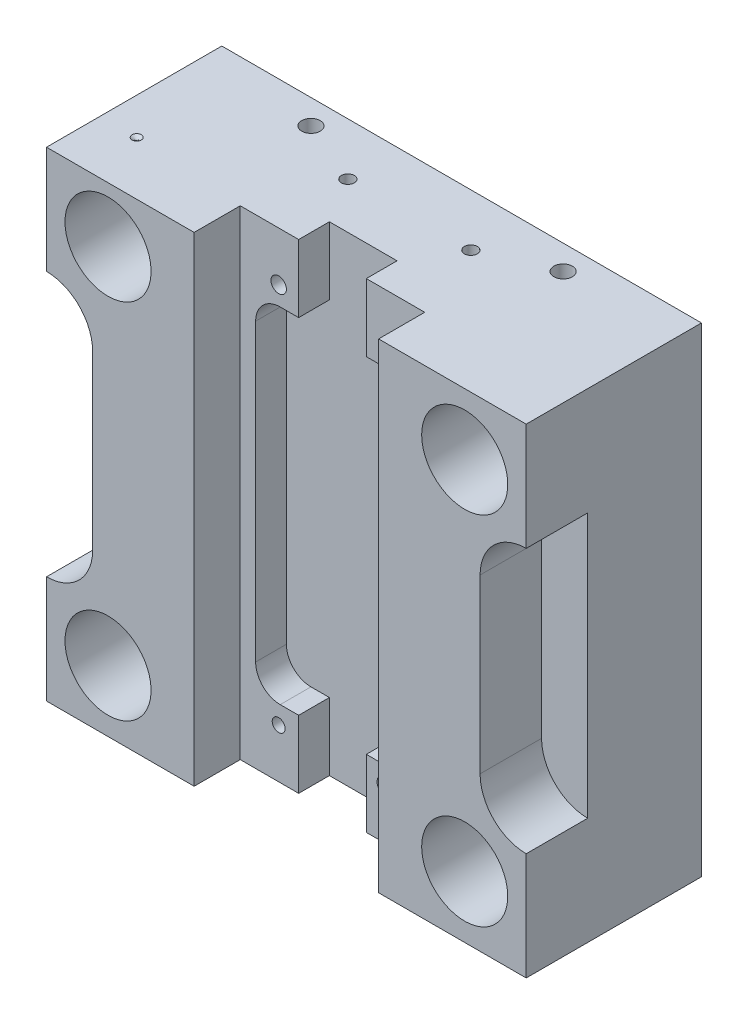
ISO-10303-21;
HEADER;
FILE_DESCRIPTION(('STEP AP214'),'2;1');
FILE_NAME('part.step','',(''),(''),'','','');
FILE_SCHEMA(('AUTOMOTIVE_DESIGN { 1 0 10303 214 1 1 1 1 }'));
ENDSEC;
DATA;
#1=APPLICATION_CONTEXT('core data for automotive mechanical design processes');
#2=APPLICATION_PROTOCOL_DEFINITION('international standard','automotive_design',2000,#1);
#3=PRODUCT_CONTEXT('',#1,'mechanical');
#4=PRODUCT('Part','Part','',(#3));
#5=PRODUCT_RELATED_PRODUCT_CATEGORY('part','',(#4));
#6=PRODUCT_DEFINITION_FORMATION('','',#4);
#7=PRODUCT_DEFINITION_CONTEXT('part definition',#1,'design');
#8=PRODUCT_DEFINITION('design','',#6,#7);
#9=PRODUCT_DEFINITION_SHAPE('','',#8);
#10=(LENGTH_UNIT() NAMED_UNIT(*) SI_UNIT(.MILLI.,.METRE.));
#11=(NAMED_UNIT(*) PLANE_ANGLE_UNIT() SI_UNIT($,.RADIAN.));
#12=(NAMED_UNIT(*) SI_UNIT($,.STERADIAN.) SOLID_ANGLE_UNIT());
#13=UNCERTAINTY_MEASURE_WITH_UNIT(LENGTH_MEASURE(1.E-05),#10,'distance_accuracy_value','');
#14=(GEOMETRIC_REPRESENTATION_CONTEXT(3) GLOBAL_UNCERTAINTY_ASSIGNED_CONTEXT((#13)) GLOBAL_UNIT_ASSIGNED_CONTEXT((#10,
#11,#12)) REPRESENTATION_CONTEXT('',''));
#15=CARTESIAN_POINT('',(0.,0.,0.));
#16=DIRECTION('',(0.,0.,1.));
#17=DIRECTION('',(1.,0.,0.));
#18=AXIS2_PLACEMENT_3D('',#15,#16,#17);
#19=CARTESIAN_POINT('',(-30.,-80.,42.));
#20=DIRECTION('',(0.,0.,1.));
#21=DIRECTION('',(1.,0.,0.));
#22=AXIS2_PLACEMENT_3D('',#19,#20,#21);
#23=PLANE('',#22);
#24=DIRECTION('',(0.,1.,0.));
#25=VECTOR('',#24,1.);
#26=CARTESIAN_POINT('',(11.,78.,42.));
#27=LINE('',#26,#25);
#28=CARTESIAN_POINT('',(11.,56.,42.));
#29=VERTEX_POINT('',#28);
#30=CARTESIAN_POINT('',(11.,78.,42.));
#31=VERTEX_POINT('',#30);
#32=EDGE_CURVE('E326',#29,#31,#27,.T.);
#33=ORIENTED_EDGE('',*,*,#32,.F.);
#34=DIRECTION('',(-1.,0.,0.));
#35=VECTOR('',#34,1.);
#36=CARTESIAN_POINT('',(11.,56.,42.));
#37=LINE('',#36,#35);
#38=CARTESIAN_POINT('',(17.,56.,42.));
#39=VERTEX_POINT('',#38);
#40=EDGE_CURVE('E323',#39,#29,#37,.T.);
#41=ORIENTED_EDGE('',*,*,#40,.F.);
#42=CARTESIAN_POINT('',(17.,48.,42.));
#43=DIRECTION('',(0.,0.,1.));
#44=DIRECTION('',(-1.,0.,0.));
#45=AXIS2_PLACEMENT_3D('',#42,#43,#44);
#46=CIRCLE('',#45,8.);
#47=CARTESIAN_POINT('',(25.,47.9999999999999,42.));
#48=VERTEX_POINT('',#47);
#49=EDGE_CURVE('E320',#48,#39,#46,.T.);
#50=ORIENTED_EDGE('',*,*,#49,.F.);
#51=DIRECTION('',(0.,1.,0.));
#52=VECTOR('',#51,1.);
#53=CARTESIAN_POINT('',(25.,47.9999999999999,42.));
#54=LINE('',#53,#52);
#55=CARTESIAN_POINT('',(25.,-48.,42.));
#56=VERTEX_POINT('',#55);
#57=EDGE_CURVE('E317',#56,#48,#54,.T.);
#58=ORIENTED_EDGE('',*,*,#57,.F.);
#59=CARTESIAN_POINT('',(17.,-48.,42.));
#60=DIRECTION('',(0.,0.,1.));
#61=DIRECTION('',(1.,0.,0.));
#62=AXIS2_PLACEMENT_3D('',#59,#60,#61);
#63=CIRCLE('',#62,8.);
#64=CARTESIAN_POINT('',(17.,-56.,42.));
#65=VERTEX_POINT('',#64);
#66=EDGE_CURVE('E314',#65,#56,#63,.T.);
#67=ORIENTED_EDGE('',*,*,#66,.F.);
#68=DIRECTION('',(1.,0.,0.));
#69=VECTOR('',#68,1.);
#70=CARTESIAN_POINT('',(11.,-56.,42.));
#71=LINE('',#70,#69);
#72=CARTESIAN_POINT('',(11.,-56.,42.));
#73=VERTEX_POINT('',#72);
#74=EDGE_CURVE('E311',#73,#65,#71,.T.);
#75=ORIENTED_EDGE('',*,*,#74,.F.);
#76=DIRECTION('',(0.,1.,0.));
#77=VECTOR('',#76,1.);
#78=CARTESIAN_POINT('',(11.,-56.,42.));
#79=LINE('',#78,#77);
#80=CARTESIAN_POINT('',(11.,-78.,42.));
#81=VERTEX_POINT('',#80);
#82=EDGE_CURVE('E308',#81,#73,#79,.T.);
#83=ORIENTED_EDGE('',*,*,#82,.F.);
#84=DIRECTION('',(1.,0.,0.));
#85=VECTOR('',#84,1.);
#86=CARTESIAN_POINT('',(-78.,-78.,42.));
#87=LINE('',#86,#85);
#88=CARTESIAN_POINT('',(30.,-78.,42.));
#89=VERTEX_POINT('',#88);
#90=EDGE_CURVE('E497',#81,#89,#87,.T.);
#91=ORIENTED_EDGE('',*,*,#90,.T.);
#92=DIRECTION('',(0.,1.,0.));
#93=VECTOR('',#92,1.);
#94=CARTESIAN_POINT('',(30.,-80.,42.));
#95=LINE('',#94,#93);
#96=CARTESIAN_POINT('',(30.,78.,42.));
#97=VERTEX_POINT('',#96);
#98=EDGE_CURVE('E495',#89,#97,#95,.T.);
#99=ORIENTED_EDGE('',*,*,#98,.T.);
#100=DIRECTION('',(-1.,0.,0.));
#101=VECTOR('',#100,1.);
#102=CARTESIAN_POINT('',(78.,78.,42.));
#103=LINE('',#102,#101);
#104=EDGE_CURVE('E569',#97,#31,#103,.T.);
#105=ORIENTED_EDGE('',*,*,#104,.T.);
#106=EDGE_LOOP('',(#33,#41,#50,#58,#67,#75,#83,#91,#99,#105));
#107=FACE_BOUND('',#106,.T.);
#108=CARTESIAN_POINT('',(17.5,-62.,42.));
#109=DIRECTION('',(0.,0.,1.));
#110=DIRECTION('',(1.,0.,0.));
#111=AXIS2_PLACEMENT_3D('',#108,#109,#110);
#112=CIRCLE('',#111,3.0035);
#113=CARTESIAN_POINT('',(14.4965,-62.,42.));
#114=VERTEX_POINT('',#113);
#115=EDGE_CURVE('E434',#114,#114,#112,.T.);
#116=ORIENTED_EDGE('',*,*,#115,.F.);
#117=EDGE_LOOP('',(#116));
#118=FACE_BOUND('',#117,.T.);
#119=CARTESIAN_POINT('',(17.5,62.,42.));
#120=DIRECTION('',(0.,0.,1.));
#121=DIRECTION('',(1.,0.,0.));
#122=AXIS2_PLACEMENT_3D('',#119,#120,#121);
#123=CIRCLE('',#122,2.1);
#124=CARTESIAN_POINT('',(19.6,62.,42.));
#125=VERTEX_POINT('',#124);
#126=EDGE_CURVE('E425',#125,#125,#123,.T.);
#127=ORIENTED_EDGE('',*,*,#126,.F.);
#128=EDGE_LOOP('',(#127));
#129=FACE_BOUND('',#128,.T.);
#130=ADVANCED_FACE('F32',(#107,#118,#129),#23,.T.);
#131=CARTESIAN_POINT('',(-78.,-78.,57.));
#132=DIRECTION('',(0.,0.,1.));
#133=DIRECTION('',(1.,0.,0.));
#134=AXIS2_PLACEMENT_3D('',#131,#132,#133);
#135=PLANE('',#134);
#136=CARTESIAN_POINT('',(-78.0000000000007,-27.9999999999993,57.));
#137=DIRECTION('',(0.,0.,1.));
#138=DIRECTION('',(1.,0.,0.));
#139=AXIS2_PLACEMENT_3D('',#136,#137,#138);
#140=CIRCLE('',#139,15.0000000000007);
#141=CARTESIAN_POINT('',(-78.,-43.,57.));
#142=VERTEX_POINT('',#141);
#143=CARTESIAN_POINT('',(-63.,-28.,57.));
#144=VERTEX_POINT('',#143);
#145=EDGE_CURVE('E454',#142,#144,#140,.T.);
#146=ORIENTED_EDGE('',*,*,#145,.F.);
#147=DIRECTION('',(0.,-1.,0.));
#148=VECTOR('',#147,1.);
#149=CARTESIAN_POINT('',(-78.,78.,57.));
#150=LINE('',#149,#148);
#151=CARTESIAN_POINT('',(-78.,-78.,57.));
#152=VERTEX_POINT('',#151);
#153=EDGE_CURVE('E540',#142,#152,#150,.T.);
#154=ORIENTED_EDGE('',*,*,#153,.T.);
#155=DIRECTION('',(1.,0.,0.));
#156=VECTOR('',#155,1.);
#157=CARTESIAN_POINT('',(-78.,-78.,57.));
#158=LINE('',#157,#156);
#159=CARTESIAN_POINT('',(-30.,-78.,57.));
#160=VERTEX_POINT('',#159);
#161=EDGE_CURVE('E545',#152,#160,#158,.T.);
#162=ORIENTED_EDGE('',*,*,#161,.T.);
#163=DIRECTION('',(0.,-1.,0.));
#164=VECTOR('',#163,1.);
#165=CARTESIAN_POINT('',(-30.,80.,57.));
#166=LINE('',#165,#164);
#167=CARTESIAN_POINT('',(-30.,78.,57.));
#168=VERTEX_POINT('',#167);
#169=EDGE_CURVE('E482',#168,#160,#166,.T.);
#170=ORIENTED_EDGE('',*,*,#169,.F.);
#171=DIRECTION('',(-1.,0.,0.));
#172=VECTOR('',#171,1.);
#173=CARTESIAN_POINT('',(78.,78.,57.));
#174=LINE('',#173,#172);
#175=CARTESIAN_POINT('',(-78.,78.,57.));
#176=VERTEX_POINT('',#175);
#177=EDGE_CURVE('E552',#168,#176,#174,.T.);
#178=ORIENTED_EDGE('',*,*,#177,.T.);
#179=CARTESIAN_POINT('',(-78.,43.,57.));
#180=VERTEX_POINT('',#179);
#181=EDGE_CURVE('E541',#176,#180,#150,.T.);
#182=ORIENTED_EDGE('',*,*,#181,.T.);
#183=CARTESIAN_POINT('',(-77.9999999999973,28.0000000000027,57.));
#184=DIRECTION('',(0.,0.,1.));
#185=DIRECTION('',(1.,0.,0.));
#186=AXIS2_PLACEMENT_3D('',#183,#184,#185);
#187=CIRCLE('',#186,14.9999999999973);
#188=CARTESIAN_POINT('',(-63.,28.,57.));
#189=VERTEX_POINT('',#188);
#190=EDGE_CURVE('E466',#189,#180,#187,.T.);
#191=ORIENTED_EDGE('',*,*,#190,.F.);
#192=DIRECTION('',(0.,1.,0.));
#193=VECTOR('',#192,1.);
#194=CARTESIAN_POINT('',(-63.,-28.,57.));
#195=LINE('',#194,#193);
#196=EDGE_CURVE('E463',#144,#189,#195,.T.);
#197=ORIENTED_EDGE('',*,*,#196,.F.);
#198=EDGE_LOOP('',(#146,#154,#162,#170,#178,#182,#191,#197));
#199=FACE_BOUND('',#198,.T.);
#200=CARTESIAN_POINT('',(-58.,60.,57.));
#201=DIRECTION('',(0.,0.,1.));
#202=DIRECTION('',(1.,0.,0.));
#203=AXIS2_PLACEMENT_3D('',#200,#201,#202);
#204=CIRCLE('',#203,14.);
#205=CARTESIAN_POINT('',(-72.,60.,57.));
#206=VERTEX_POINT('',#205);
#207=EDGE_CURVE('E510',#206,#206,#204,.T.);
#208=ORIENTED_EDGE('',*,*,#207,.F.);
#209=EDGE_LOOP('',(#208));
#210=FACE_BOUND('',#209,.T.);
#211=CARTESIAN_POINT('',(-58.,-58.,57.));
#212=DIRECTION('',(0.,0.,1.));
#213=DIRECTION('',(1.,0.,0.));
#214=AXIS2_PLACEMENT_3D('',#211,#212,#213);
#215=CIRCLE('',#214,14.);
#216=CARTESIAN_POINT('',(-72.,-58.,57.));
#217=VERTEX_POINT('',#216);
#218=EDGE_CURVE('E516',#217,#217,#215,.T.);
#219=ORIENTED_EDGE('',*,*,#218,.F.);
#220=EDGE_LOOP('',(#219));
#221=FACE_BOUND('',#220,.T.);
#222=ADVANCED_FACE('F581',(#199,#210,#221),#135,.T.);
#223=CARTESIAN_POINT('',(78.0000000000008,-27.9999999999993,57.));
#224=DIRECTION('',(0.,0.,1.));
#225=DIRECTION('',(1.,0.,0.));
#226=AXIS2_PLACEMENT_3D('',#223,#224,#225);
#227=CIRCLE('',#226,15.0000000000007);
#228=CARTESIAN_POINT('',(63.,-28.,57.));
#229=VERTEX_POINT('',#228);
#230=CARTESIAN_POINT('',(78.,-43.,57.));
#231=VERTEX_POINT('',#230);
#232=EDGE_CURVE('E435',#229,#231,#227,.T.);
#233=ORIENTED_EDGE('',*,*,#232,.F.);
#234=DIRECTION('',(0.,-1.,0.));
#235=VECTOR('',#234,1.);
#236=CARTESIAN_POINT('',(63.,28.,57.));
#237=LINE('',#236,#235);
#238=CARTESIAN_POINT('',(63.,28.,57.));
#239=VERTEX_POINT('',#238);
#240=EDGE_CURVE('E440',#239,#229,#237,.T.);
#241=ORIENTED_EDGE('',*,*,#240,.F.);
#242=CARTESIAN_POINT('',(77.9999999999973,28.0000000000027,57.));
#243=DIRECTION('',(0.,0.,1.));
#244=DIRECTION('',(1.,0.,0.));
#245=AXIS2_PLACEMENT_3D('',#242,#243,#244);
#246=CIRCLE('',#245,14.9999999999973);
#247=CARTESIAN_POINT('',(78.,43.,57.));
#248=VERTEX_POINT('',#247);
#249=EDGE_CURVE('E437',#248,#239,#246,.T.);
#250=ORIENTED_EDGE('',*,*,#249,.F.);
#251=DIRECTION('',(0.,1.,0.));
#252=VECTOR('',#251,1.);
#253=CARTESIAN_POINT('',(78.,-78.,57.));
#254=LINE('',#253,#252);
#255=CARTESIAN_POINT('',(78.,78.,57.));
#256=VERTEX_POINT('',#255);
#257=EDGE_CURVE('E548',#248,#256,#254,.T.);
#258=ORIENTED_EDGE('',*,*,#257,.T.);
#259=CARTESIAN_POINT('',(30.,78.,57.));
#260=VERTEX_POINT('',#259);
#261=EDGE_CURVE('E553',#256,#260,#174,.T.);
#262=ORIENTED_EDGE('',*,*,#261,.T.);
#263=DIRECTION('',(0.,1.,0.));
#264=VECTOR('',#263,1.);
#265=CARTESIAN_POINT('',(30.,-80.,57.));
#266=LINE('',#265,#264);
#267=CARTESIAN_POINT('',(30.,-78.,57.));
#268=VERTEX_POINT('',#267);
#269=EDGE_CURVE('E490',#268,#260,#266,.T.);
#270=ORIENTED_EDGE('',*,*,#269,.F.);
#271=CARTESIAN_POINT('',(78.,-78.,57.));
#272=VERTEX_POINT('',#271);
#273=EDGE_CURVE('E544',#268,#272,#158,.T.);
#274=ORIENTED_EDGE('',*,*,#273,.T.);
#275=EDGE_CURVE('E549',#272,#231,#254,.T.);
#276=ORIENTED_EDGE('',*,*,#275,.T.);
#277=EDGE_LOOP('',(#233,#241,#250,#258,#262,#270,#274,#276));
#278=FACE_BOUND('',#277,.T.);
#279=CARTESIAN_POINT('',(58.,58.,57.));
#280=DIRECTION('',(0.,0.,1.));
#281=DIRECTION('',(1.,0.,0.));
#282=AXIS2_PLACEMENT_3D('',#279,#280,#281);
#283=CIRCLE('',#282,14.);
#284=CARTESIAN_POINT('',(44.,58.,57.));
#285=VERTEX_POINT('',#284);
#286=EDGE_CURVE('E528',#285,#285,#283,.T.);
#287=ORIENTED_EDGE('',*,*,#286,.F.);
#288=EDGE_LOOP('',(#287));
#289=FACE_BOUND('',#288,.T.);
#290=CARTESIAN_POINT('',(58.,-58.,57.));
#291=DIRECTION('',(0.,0.,1.));
#292=DIRECTION('',(1.,0.,0.));
#293=AXIS2_PLACEMENT_3D('',#290,#291,#292);
#294=CIRCLE('',#293,14.);
#295=CARTESIAN_POINT('',(44.,-58.,57.));
#296=VERTEX_POINT('',#295);
#297=EDGE_CURVE('E522',#296,#296,#294,.T.);
#298=ORIENTED_EDGE('',*,*,#297,.F.);
#299=EDGE_LOOP('',(#298));
#300=FACE_BOUND('',#299,.T.);
#301=ADVANCED_FACE('F668',(#278,#289,#300),#135,.T.);
#302=CARTESIAN_POINT('',(-78.,-78.,0.));
#303=DIRECTION('',(0.,0.,1.));
#304=DIRECTION('',(1.,0.,0.));
#305=AXIS2_PLACEMENT_3D('',#302,#303,#304);
#306=PLANE('',#305);
#307=CARTESIAN_POINT('',(-17.5,62.,0.));
#308=DIRECTION('',(0.,0.,-1.));
#309=DIRECTION('',(-1.,0.,0.));
#310=AXIS2_PLACEMENT_3D('',#307,#308,#309);
#311=CIRCLE('',#310,2.5035);
#312=CARTESIAN_POINT('',(-20.0035,62.,0.));
#313=VERTEX_POINT('',#312);
#314=EDGE_CURVE('E428',#313,#313,#311,.T.);
#315=ORIENTED_EDGE('',*,*,#314,.F.);
#316=EDGE_LOOP('',(#315));
#317=FACE_BOUND('',#316,.T.);
#318=CARTESIAN_POINT('',(17.5,-62.,0.));
#319=DIRECTION('',(0.,0.,-1.));
#320=DIRECTION('',(-1.,0.,0.));
#321=AXIS2_PLACEMENT_3D('',#318,#319,#320);
#322=CIRCLE('',#321,3.0035);
#323=CARTESIAN_POINT('',(14.4965,-62.,0.));
#324=VERTEX_POINT('',#323);
#325=EDGE_CURVE('E431',#324,#324,#322,.T.);
#326=ORIENTED_EDGE('',*,*,#325,.F.);
#327=EDGE_LOOP('',(#326));
#328=FACE_BOUND('',#327,.T.);
#329=CARTESIAN_POINT('',(-58.,-58.,0.));
#330=DIRECTION('',(0.,0.,1.));
#331=DIRECTION('',(1.,0.,0.));
#332=AXIS2_PLACEMENT_3D('',#329,#330,#331);
#333=CIRCLE('',#332,14.);
#334=CARTESIAN_POINT('',(-72.,-58.,0.));
#335=VERTEX_POINT('',#334);
#336=EDGE_CURVE('E513',#335,#335,#333,.T.);
#337=ORIENTED_EDGE('',*,*,#336,.T.);
#338=EDGE_LOOP('',(#337));
#339=FACE_BOUND('',#338,.T.);
#340=CARTESIAN_POINT('',(58.,58.,0.));
#341=DIRECTION('',(0.,0.,1.));
#342=DIRECTION('',(1.,0.,0.));
#343=AXIS2_PLACEMENT_3D('',#340,#341,#342);
#344=CIRCLE('',#343,14.);
#345=CARTESIAN_POINT('',(44.,58.,0.));
#346=VERTEX_POINT('',#345);
#347=EDGE_CURVE('E525',#346,#346,#344,.T.);
#348=ORIENTED_EDGE('',*,*,#347,.T.);
#349=EDGE_LOOP('',(#348));
#350=FACE_BOUND('',#349,.T.);
#351=DIRECTION('',(0.,-1.,0.));
#352=VECTOR('',#351,1.);
#353=CARTESIAN_POINT('',(-78.,78.,0.));
#354=LINE('',#353,#352);
#355=CARTESIAN_POINT('',(-78.,78.,0.));
#356=VERTEX_POINT('',#355);
#357=CARTESIAN_POINT('',(-78.,-78.,0.));
#358=VERTEX_POINT('',#357);
#359=EDGE_CURVE('E531',#356,#358,#354,.T.);
#360=ORIENTED_EDGE('',*,*,#359,.F.);
#361=DIRECTION('',(-1.,0.,0.));
#362=VECTOR('',#361,1.);
#363=CARTESIAN_POINT('',(78.,78.,0.));
#364=LINE('',#363,#362);
#365=CARTESIAN_POINT('',(78.,78.,0.));
#366=VERTEX_POINT('',#365);
#367=EDGE_CURVE('E538',#366,#356,#364,.T.);
#368=ORIENTED_EDGE('',*,*,#367,.F.);
#369=DIRECTION('',(0.,1.,0.));
#370=VECTOR('',#369,1.);
#371=CARTESIAN_POINT('',(78.,-78.,0.));
#372=LINE('',#371,#370);
#373=CARTESIAN_POINT('',(78.,-78.,0.));
#374=VERTEX_POINT('',#373);
#375=EDGE_CURVE('E536',#374,#366,#372,.T.);
#376=ORIENTED_EDGE('',*,*,#375,.F.);
#377=DIRECTION('',(1.,0.,0.));
#378=VECTOR('',#377,1.);
#379=CARTESIAN_POINT('',(-78.,-78.,0.));
#380=LINE('',#379,#378);
#381=EDGE_CURVE('E534',#358,#374,#380,.T.);
#382=ORIENTED_EDGE('',*,*,#381,.F.);
#383=EDGE_LOOP('',(#360,#368,#376,#382));
#384=FACE_BOUND('',#383,.T.);
#385=CARTESIAN_POINT('',(58.,-58.,0.));
#386=DIRECTION('',(0.,0.,1.));
#387=DIRECTION('',(1.,0.,0.));
#388=AXIS2_PLACEMENT_3D('',#385,#386,#387);
#389=CIRCLE('',#388,14.);
#390=CARTESIAN_POINT('',(44.,-58.,0.));
#391=VERTEX_POINT('',#390);
#392=EDGE_CURVE('E519',#391,#391,#389,.T.);
#393=ORIENTED_EDGE('',*,*,#392,.T.);
#394=EDGE_LOOP('',(#393));
#395=FACE_BOUND('',#394,.T.);
#396=CARTESIAN_POINT('',(-58.,60.,0.));
#397=DIRECTION('',(0.,0.,1.));
#398=DIRECTION('',(1.,0.,0.));
#399=AXIS2_PLACEMENT_3D('',#396,#397,#398);
#400=CIRCLE('',#399,14.);
#401=CARTESIAN_POINT('',(-72.,60.,0.));
#402=VERTEX_POINT('',#401);
#403=EDGE_CURVE('E507',#402,#402,#400,.T.);
#404=ORIENTED_EDGE('',*,*,#403,.T.);
#405=EDGE_LOOP('',(#404));
#406=FACE_BOUND('',#405,.T.);
#407=ADVANCED_FACE('F665',(#317,#328,#339,#350,#384,#395,#406),#306,.F.);
#408=CARTESIAN_POINT('',(-78.,78.,57.));
#409=DIRECTION('',(1.,0.,0.));
#410=DIRECTION('',(0.,0.,-1.));
#411=AXIS2_PLACEMENT_3D('',#408,#409,#410);
#412=PLANE('',#411);
#413=ORIENTED_EDGE('',*,*,#153,.F.);
#414=DIRECTION('',(0.,0.,1.));
#415=VECTOR('',#414,1.);
#416=CARTESIAN_POINT('',(-78.,-43.,37.));
#417=LINE('',#416,#415);
#418=CARTESIAN_POINT('',(-78.,-43.,37.));
#419=VERTEX_POINT('',#418);
#420=EDGE_CURVE('E480',#419,#142,#417,.T.);
#421=ORIENTED_EDGE('',*,*,#420,.F.);
#422=DIRECTION('',(0.,-1.,0.));
#423=VECTOR('',#422,1.);
#424=CARTESIAN_POINT('',(-78.,43.,37.));
#425=LINE('',#424,#423);
#426=CARTESIAN_POINT('',(-78.,43.,37.));
#427=VERTEX_POINT('',#426);
#428=EDGE_CURVE('E476',#427,#419,#425,.T.);
#429=ORIENTED_EDGE('',*,*,#428,.F.);
#430=DIRECTION('',(0.,0.,1.));
#431=VECTOR('',#430,1.);
#432=CARTESIAN_POINT('',(-78.,43.,37.));
#433=LINE('',#432,#431);
#434=EDGE_CURVE('E483',#427,#180,#433,.T.);
#435=ORIENTED_EDGE('',*,*,#434,.T.);
#436=ORIENTED_EDGE('',*,*,#181,.F.);
#437=DIRECTION('',(0.,0.,-1.));
#438=VECTOR('',#437,1.);
#439=CARTESIAN_POINT('',(-78.,78.,57.));
#440=LINE('',#439,#438);
#441=EDGE_CURVE('E556',#176,#356,#440,.T.);
#442=ORIENTED_EDGE('',*,*,#441,.T.);
#443=ORIENTED_EDGE('',*,*,#359,.T.);
#444=DIRECTION('',(0.,0.,-1.));
#445=VECTOR('',#444,1.);
#446=CARTESIAN_POINT('',(-78.,-78.,57.));
#447=LINE('',#446,#445);
#448=EDGE_CURVE('E565',#152,#358,#447,.T.);
#449=ORIENTED_EDGE('',*,*,#448,.F.);
#450=EDGE_LOOP('',(#413,#421,#429,#435,#436,#442,#443,#449));
#451=FACE_BOUND('',#450,.T.);
#452=ADVANCED_FACE('F34',(#451),#412,.F.);
#453=CARTESIAN_POINT('',(-78.,-78.,57.));
#454=DIRECTION('',(0.,1.,0.));
#455=DIRECTION('',(0.,0.,1.));
#456=AXIS2_PLACEMENT_3D('',#453,#454,#455);
#457=PLANE('',#456);
#458=ORIENTED_EDGE('',*,*,#90,.F.);
#459=DIRECTION('',(0.,0.,1.));
#460=VECTOR('',#459,1.);
#461=CARTESIAN_POINT('',(11.,-78.,32.));
#462=LINE('',#461,#460);
#463=CARTESIAN_POINT('',(11.,-78.,32.));
#464=VERTEX_POINT('',#463);
#465=EDGE_CURVE('E405',#464,#81,#462,.T.);
#466=ORIENTED_EDGE('',*,*,#465,.F.);
#467=DIRECTION('',(1.,0.,0.));
#468=VECTOR('',#467,1.);
#469=CARTESIAN_POINT('',(-11.,-78.,32.));
#470=LINE('',#469,#468);
#471=CARTESIAN_POINT('',(-11.,-78.,32.));
#472=VERTEX_POINT('',#471);
#473=EDGE_CURVE('E349',#472,#464,#470,.T.);
#474=ORIENTED_EDGE('',*,*,#473,.F.);
#475=DIRECTION('',(0.,0.,1.));
#476=VECTOR('',#475,1.);
#477=CARTESIAN_POINT('',(-11.,-78.,32.));
#478=LINE('',#477,#476);
#479=CARTESIAN_POINT('',(-11.,-78.,42.));
#480=VERTEX_POINT('',#479);
#481=EDGE_CURVE('E407',#472,#480,#478,.T.);
#482=ORIENTED_EDGE('',*,*,#481,.T.);
#483=CARTESIAN_POINT('',(-30.,-78.,42.));
#484=VERTEX_POINT('',#483);
#485=EDGE_CURVE('E498',#484,#480,#87,.T.);
#486=ORIENTED_EDGE('',*,*,#485,.F.);
#487=DIRECTION('',(0.,0.,1.));
#488=VECTOR('',#487,1.);
#489=CARTESIAN_POINT('',(-30.,-78.,57.));
#490=LINE('',#489,#488);
#491=EDGE_CURVE('E504',#484,#160,#490,.T.);
#492=ORIENTED_EDGE('',*,*,#491,.T.);
#493=ORIENTED_EDGE('',*,*,#161,.F.);
#494=ORIENTED_EDGE('',*,*,#448,.T.);
#495=ORIENTED_EDGE('',*,*,#381,.T.);
#496=DIRECTION('',(0.,0.,-1.));
#497=VECTOR('',#496,1.);
#498=CARTESIAN_POINT('',(78.,-78.,57.));
#499=LINE('',#498,#497);
#500=EDGE_CURVE('E562',#272,#374,#499,.T.);
#501=ORIENTED_EDGE('',*,*,#500,.F.);
#502=ORIENTED_EDGE('',*,*,#273,.F.);
#503=DIRECTION('',(0.,0.,-1.));
#504=VECTOR('',#503,1.);
#505=CARTESIAN_POINT('',(30.,-78.,57.));
#506=LINE('',#505,#504);
#507=EDGE_CURVE('E501',#268,#89,#506,.T.);
#508=ORIENTED_EDGE('',*,*,#507,.T.);
#509=EDGE_LOOP('',(#458,#466,#474,#482,#486,#492,#493,#494,#495,#501,#502,#508));
#510=FACE_BOUND('',#509,.T.);
#511=ADVANCED_FACE('F678',(#510),#457,.F.);
#512=CARTESIAN_POINT('',(78.,-78.,57.));
#513=DIRECTION('',(-1.,0.,0.));
#514=DIRECTION('',(0.,0.,1.));
#515=AXIS2_PLACEMENT_3D('',#512,#513,#514);
#516=PLANE('',#515);
#517=DIRECTION('',(0.,1.,0.));
#518=VECTOR('',#517,1.);
#519=CARTESIAN_POINT('',(78.,-43.,37.));
#520=LINE('',#519,#518);
#521=CARTESIAN_POINT('',(78.,-43.,37.));
#522=VERTEX_POINT('',#521);
#523=CARTESIAN_POINT('',(78.,43.,37.));
#524=VERTEX_POINT('',#523);
#525=EDGE_CURVE('E444',#522,#524,#520,.T.);
#526=ORIENTED_EDGE('',*,*,#525,.F.);
#527=DIRECTION('',(0.,0.,1.));
#528=VECTOR('',#527,1.);
#529=CARTESIAN_POINT('',(78.,-43.,37.));
#530=LINE('',#529,#528);
#531=EDGE_CURVE('E451',#522,#231,#530,.T.);
#532=ORIENTED_EDGE('',*,*,#531,.T.);
#533=ORIENTED_EDGE('',*,*,#275,.F.);
#534=ORIENTED_EDGE('',*,*,#500,.T.);
#535=ORIENTED_EDGE('',*,*,#375,.T.);
#536=DIRECTION('',(0.,0.,-1.));
#537=VECTOR('',#536,1.);
#538=CARTESIAN_POINT('',(78.,78.,57.));
#539=LINE('',#538,#537);
#540=EDGE_CURVE('E559',#256,#366,#539,.T.);
#541=ORIENTED_EDGE('',*,*,#540,.F.);
#542=ORIENTED_EDGE('',*,*,#257,.F.);
#543=DIRECTION('',(0.,0.,1.));
#544=VECTOR('',#543,1.);
#545=CARTESIAN_POINT('',(78.,43.,37.));
#546=LINE('',#545,#544);
#547=EDGE_CURVE('E457',#524,#248,#546,.T.);
#548=ORIENTED_EDGE('',*,*,#547,.F.);
#549=EDGE_LOOP('',(#526,#532,#533,#534,#535,#541,#542,#548));
#550=FACE_BOUND('',#549,.T.);
#551=ADVANCED_FACE('F675',(#550),#516,.F.);
#552=CARTESIAN_POINT('',(78.,78.,57.));
#553=DIRECTION('',(0.,-1.,0.));
#554=DIRECTION('',(0.,0.,-1.));
#555=AXIS2_PLACEMENT_3D('',#552,#553,#554);
#556=PLANE('',#555);
#557=CARTESIAN_POINT('',(-20.,78.,17.));
#558=DIRECTION('',(0.,1.,0.));
#559=DIRECTION('',(0.,0.,1.));
#560=AXIS2_PLACEMENT_3D('',#557,#558,#559);
#561=CIRCLE('',#560,2.09999999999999);
#562=CARTESIAN_POINT('',(-20.,78.,19.1));
#563=VERTEX_POINT('',#562);
#564=EDGE_CURVE('E267',#563,#563,#561,.T.);
#565=ORIENTED_EDGE('',*,*,#564,.F.);
#566=EDGE_LOOP('',(#565));
#567=FACE_BOUND('',#566,.T.);
#568=CARTESIAN_POINT('',(20.,78.,17.));
#569=DIRECTION('',(0.,1.,0.));
#570=DIRECTION('',(0.,0.,1.));
#571=AXIS2_PLACEMENT_3D('',#568,#569,#570);
#572=CIRCLE('',#571,2.09999999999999);
#573=CARTESIAN_POINT('',(20.,78.,19.1));
#574=VERTEX_POINT('',#573);
#575=EDGE_CURVE('E275',#574,#574,#572,.T.);
#576=ORIENTED_EDGE('',*,*,#575,.F.);
#577=EDGE_LOOP('',(#576));
#578=FACE_BOUND('',#577,.T.);
#579=CARTESIAN_POINT('',(41.,78.,8.00000000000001));
#580=DIRECTION('',(0.,1.,0.));
#581=DIRECTION('',(0.,0.,1.));
#582=AXIS2_PLACEMENT_3D('',#579,#580,#581);
#583=CIRCLE('',#582,3.004);
#584=CARTESIAN_POINT('',(41.,78.,11.004));
#585=VERTEX_POINT('',#584);
#586=EDGE_CURVE('E278',#585,#585,#583,.T.);
#587=ORIENTED_EDGE('',*,*,#586,.F.);
#588=EDGE_LOOP('',(#587));
#589=FACE_BOUND('',#588,.T.);
#590=CARTESIAN_POINT('',(-41.,78.,8.00000000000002));
#591=DIRECTION('',(0.,1.,0.));
#592=DIRECTION('',(0.,0.,1.));
#593=AXIS2_PLACEMENT_3D('',#590,#591,#592);
#594=CIRCLE('',#593,3.004);
#595=CARTESIAN_POINT('',(-41.,78.,11.004));
#596=VERTEX_POINT('',#595);
#597=EDGE_CURVE('E284',#596,#596,#594,.T.);
#598=ORIENTED_EDGE('',*,*,#597,.F.);
#599=EDGE_LOOP('',(#598));
#600=FACE_BOUND('',#599,.T.);
#601=CARTESIAN_POINT('',(-66.102330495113,78.,39.5719288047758));
#602=DIRECTION('',(0.,1.,0.));
#603=DIRECTION('',(0.,0.,1.));
#604=AXIS2_PLACEMENT_3D('',#601,#602,#603);
#605=CIRCLE('',#604,1.49999999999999);
#606=CARTESIAN_POINT('',(-66.102330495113,78.,41.0719288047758));
#607=VERTEX_POINT('',#606);
#608=EDGE_CURVE('E293',#607,#607,#605,.T.);
#609=ORIENTED_EDGE('',*,*,#608,.F.);
#610=EDGE_LOOP('',(#609));
#611=FACE_BOUND('',#610,.T.);
#612=CARTESIAN_POINT('',(-11.,78.,42.));
#613=VERTEX_POINT('',#612);
#614=CARTESIAN_POINT('',(-30.,78.,42.));
#615=VERTEX_POINT('',#614);
#616=EDGE_CURVE('E568',#613,#615,#103,.T.);
#617=ORIENTED_EDGE('',*,*,#616,.F.);
#618=DIRECTION('',(0.,0.,1.));
#619=VECTOR('',#618,1.);
#620=CARTESIAN_POINT('',(-11.,78.,32.));
#621=LINE('',#620,#619);
#622=CARTESIAN_POINT('',(-11.,78.,32.));
#623=VERTEX_POINT('',#622);
#624=EDGE_CURVE('E388',#623,#613,#621,.T.);
#625=ORIENTED_EDGE('',*,*,#624,.F.);
#626=DIRECTION('',(-1.,0.,0.));
#627=VECTOR('',#626,1.);
#628=CARTESIAN_POINT('',(11.,78.,32.));
#629=LINE('',#628,#627);
#630=CARTESIAN_POINT('',(11.,78.,32.));
#631=VERTEX_POINT('',#630);
#632=EDGE_CURVE('E373',#631,#623,#629,.T.);
#633=ORIENTED_EDGE('',*,*,#632,.F.);
#634=DIRECTION('',(0.,0.,1.));
#635=VECTOR('',#634,1.);
#636=CARTESIAN_POINT('',(11.,78.,32.));
#637=LINE('',#636,#635);
#638=EDGE_CURVE('E390',#631,#31,#637,.T.);
#639=ORIENTED_EDGE('',*,*,#638,.T.);
#640=ORIENTED_EDGE('',*,*,#104,.F.);
#641=DIRECTION('',(0.,0.,1.));
#642=VECTOR('',#641,1.);
#643=CARTESIAN_POINT('',(30.,78.,57.));
#644=LINE('',#643,#642);
#645=EDGE_CURVE('E41',#97,#260,#644,.T.);
#646=ORIENTED_EDGE('',*,*,#645,.T.);
#647=ORIENTED_EDGE('',*,*,#261,.F.);
#648=ORIENTED_EDGE('',*,*,#540,.T.);
#649=ORIENTED_EDGE('',*,*,#367,.T.);
#650=ORIENTED_EDGE('',*,*,#441,.F.);
#651=ORIENTED_EDGE('',*,*,#177,.F.);
#652=DIRECTION('',(0.,0.,-1.));
#653=VECTOR('',#652,1.);
#654=CARTESIAN_POINT('',(-30.,78.,57.));
#655=LINE('',#654,#653);
#656=EDGE_CURVE('E11',#168,#615,#655,.T.);
#657=ORIENTED_EDGE('',*,*,#656,.T.);
#658=EDGE_LOOP('',(#617,#625,#633,#639,#640,#646,#647,#648,#649,#650,#651,#657));
#659=FACE_BOUND('',#658,.T.);
#660=ADVANCED_FACE('F663',(#567,#578,#589,#600,#611,#659),#556,.F.);
#661=CARTESIAN_POINT('',(58.,58.,57.));
#662=DIRECTION('',(0.,0.,-1.));
#663=DIRECTION('',(-1.,0.,0.));
#664=AXIS2_PLACEMENT_3D('',#661,#662,#663);
#665=CYLINDRICAL_SURFACE('',#664,14.);
#666=CARTESIAN_POINT('',(44.,58.,57.));
#667=CARTESIAN_POINT('',(44.,58.,56.40625));
#668=CARTESIAN_POINT('',(44.,58.,55.8125));
#669=CARTESIAN_POINT('',(44.,58.,54.625));
#670=CARTESIAN_POINT('',(44.,58.,54.03125));
#671=CARTESIAN_POINT('',(44.,58.,52.84375));
#672=CARTESIAN_POINT('',(44.,58.,52.25));
#673=CARTESIAN_POINT('',(44.,58.,51.0625));
#674=CARTESIAN_POINT('',(44.,58.,50.46875));
#675=CARTESIAN_POINT('',(44.,58.,49.28125));
#676=CARTESIAN_POINT('',(44.,58.,48.6875));
#677=CARTESIAN_POINT('',(44.,58.,47.5));
#678=CARTESIAN_POINT('',(44.,58.,46.90625));
#679=CARTESIAN_POINT('',(44.,58.,45.71875));
#680=CARTESIAN_POINT('',(44.,58.,45.125));
#681=CARTESIAN_POINT('',(44.,58.,43.9375));
#682=CARTESIAN_POINT('',(44.,58.,43.34375));
#683=CARTESIAN_POINT('',(44.,58.,42.15625));
#684=CARTESIAN_POINT('',(44.,58.,41.5625));
#685=CARTESIAN_POINT('',(44.,58.,40.375));
#686=CARTESIAN_POINT('',(44.,58.,39.78125));
#687=CARTESIAN_POINT('',(44.,58.,38.59375));
#688=CARTESIAN_POINT('',(44.,58.,38.));
#689=CARTESIAN_POINT('',(44.,58.,36.8125));
#690=CARTESIAN_POINT('',(44.,58.,36.21875));
#691=CARTESIAN_POINT('',(44.,58.,35.03125));
#692=CARTESIAN_POINT('',(44.,58.,34.4375));
#693=CARTESIAN_POINT('',(44.,58.,33.25));
#694=CARTESIAN_POINT('',(44.,58.,32.65625));
#695=CARTESIAN_POINT('',(44.,58.,31.46875));
#696=CARTESIAN_POINT('',(44.,58.,30.875));
#697=CARTESIAN_POINT('',(44.,58.,29.6875));
#698=CARTESIAN_POINT('',(44.,58.,29.09375));
#699=CARTESIAN_POINT('',(44.,58.,27.90625));
#700=CARTESIAN_POINT('',(44.,58.,27.3125));
#701=CARTESIAN_POINT('',(44.,58.,26.125));
#702=CARTESIAN_POINT('',(44.,58.,25.53125));
#703=CARTESIAN_POINT('',(44.,58.,24.34375));
#704=CARTESIAN_POINT('',(44.,58.,23.75));
#705=CARTESIAN_POINT('',(44.,58.,22.5625));
#706=CARTESIAN_POINT('',(44.,58.,21.96875));
#707=CARTESIAN_POINT('',(44.,58.,20.78125));
#708=CARTESIAN_POINT('',(44.,58.,20.1875));
#709=CARTESIAN_POINT('',(44.,58.,19.));
#710=CARTESIAN_POINT('',(44.,58.,18.40625));
#711=CARTESIAN_POINT('',(44.,58.,17.21875));
#712=CARTESIAN_POINT('',(44.,58.,16.625));
#713=CARTESIAN_POINT('',(44.,58.,15.4375));
#714=CARTESIAN_POINT('',(44.,58.,14.84375));
#715=CARTESIAN_POINT('',(44.,58.,13.65625));
#716=CARTESIAN_POINT('',(44.,58.,13.0625));
#717=CARTESIAN_POINT('',(44.,58.,11.875));
#718=CARTESIAN_POINT('',(44.,58.,11.28125));
#719=CARTESIAN_POINT('',(44.,58.,10.09375));
#720=CARTESIAN_POINT('',(44.,58.,9.5));
#721=CARTESIAN_POINT('',(44.,58.,8.3125));
#722=CARTESIAN_POINT('',(44.,58.,7.71875));
#723=CARTESIAN_POINT('',(44.,58.,6.53125));
#724=CARTESIAN_POINT('',(44.,58.,5.9375));
#725=CARTESIAN_POINT('',(44.,58.,4.75));
#726=CARTESIAN_POINT('',(44.,58.,4.15625));
#727=CARTESIAN_POINT('',(44.,58.,2.96875));
#728=CARTESIAN_POINT('',(44.,58.,2.375));
#729=CARTESIAN_POINT('',(44.,58.,1.1875));
#730=CARTESIAN_POINT('',(44.,58.,0.593749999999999));
#731=CARTESIAN_POINT('',(44.,58.,0.));
#732=B_SPLINE_CURVE_WITH_KNOTS('',3,(#666,#667,#668,#669,#670,#671,#672,#673,#674,#675,#676,
#677,#678,#679,#680,#681,#682,#683,#684,#685,#686,#687,#688,#689,#690,#691,#692,#693,#694,#695,
#696,#697,#698,#699,#700,#701,#702,#703,#704,#705,#706,#707,#708,#709,#710,#711,#712,#713,#714,
#715,#716,#717,#718,#719,#720,#721,#722,#723,#724,#725,#726,#727,#728,#729,#730,#731),
.UNSPECIFIED.,.F.,.F.,(4,2,2,2,2,2,2,2,2,2,2,2,2,2,2,2,2,2,2,2,2,2,2,2,2,2,2,2,2,2,2,2,4),(0.,
1.78125000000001,3.5625,5.34375,7.12500000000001,8.90625,10.6875,12.46875,14.25,16.03125,
17.8125,19.59375,21.375,23.15625,24.9375,26.71875,28.5,30.28125,32.0625,33.84375,35.625,
37.40625,39.1875,40.96875,42.75,44.53125,46.3125,48.09375,49.875,51.65625,53.4375,55.21875,57.),.UNSPECIFIED.);
#733=EDGE_CURVE('BSEAM659',#285,#346,#732,.T.);
#734=ORIENTED_EDGE('',*,*,#286,.T.);
#735=ORIENTED_EDGE('',*,*,#347,.F.);
#736=ORIENTED_EDGE('',*,*,#733,.T.);
#737=ORIENTED_EDGE('',*,*,#733,.F.);
#738=EDGE_LOOP('',(#734,#736,#735,#737));
#739=FACE_BOUND('',#738,.T.);
#740=ADVANCED_FACE('F659',(#739),#665,.F.);
#741=CARTESIAN_POINT('',(58.,-58.,57.));
#742=DIRECTION('',(0.,0.,-1.));
#743=DIRECTION('',(-1.,0.,0.));
#744=AXIS2_PLACEMENT_3D('',#741,#742,#743);
#745=CYLINDRICAL_SURFACE('',#744,14.);
#746=CARTESIAN_POINT('',(44.,-58.,57.));
#747=CARTESIAN_POINT('',(44.,-58.,56.40625));
#748=CARTESIAN_POINT('',(44.,-58.,55.8125));
#749=CARTESIAN_POINT('',(44.,-58.,54.625));
#750=CARTESIAN_POINT('',(44.,-58.,54.03125));
#751=CARTESIAN_POINT('',(44.,-58.,52.84375));
#752=CARTESIAN_POINT('',(44.,-58.,52.25));
#753=CARTESIAN_POINT('',(44.,-58.,51.0625));
#754=CARTESIAN_POINT('',(44.,-58.,50.46875));
#755=CARTESIAN_POINT('',(44.,-58.,49.28125));
#756=CARTESIAN_POINT('',(44.,-58.,48.6875));
#757=CARTESIAN_POINT('',(44.,-58.,47.5));
#758=CARTESIAN_POINT('',(44.,-58.,46.90625));
#759=CARTESIAN_POINT('',(44.,-58.,45.71875));
#760=CARTESIAN_POINT('',(44.,-58.,45.125));
#761=CARTESIAN_POINT('',(44.,-58.,43.9375));
#762=CARTESIAN_POINT('',(44.,-58.,43.34375));
#763=CARTESIAN_POINT('',(44.,-58.,42.15625));
#764=CARTESIAN_POINT('',(44.,-58.,41.5625));
#765=CARTESIAN_POINT('',(44.,-58.,40.375));
#766=CARTESIAN_POINT('',(44.,-58.,39.78125));
#767=CARTESIAN_POINT('',(44.,-58.,38.59375));
#768=CARTESIAN_POINT('',(44.,-58.,38.));
#769=CARTESIAN_POINT('',(44.,-58.,36.8125));
#770=CARTESIAN_POINT('',(44.,-58.,36.21875));
#771=CARTESIAN_POINT('',(44.,-58.,35.03125));
#772=CARTESIAN_POINT('',(44.,-58.,34.4375));
#773=CARTESIAN_POINT('',(44.,-58.,33.25));
#774=CARTESIAN_POINT('',(44.,-58.,32.65625));
#775=CARTESIAN_POINT('',(44.,-58.,31.46875));
#776=CARTESIAN_POINT('',(44.,-58.,30.875));
#777=CARTESIAN_POINT('',(44.,-58.,29.6875));
#778=CARTESIAN_POINT('',(44.,-58.,29.09375));
#779=CARTESIAN_POINT('',(44.,-58.,27.90625));
#780=CARTESIAN_POINT('',(44.,-58.,27.3125));
#781=CARTESIAN_POINT('',(44.,-58.,26.125));
#782=CARTESIAN_POINT('',(44.,-58.,25.53125));
#783=CARTESIAN_POINT('',(44.,-58.,24.34375));
#784=CARTESIAN_POINT('',(44.,-58.,23.75));
#785=CARTESIAN_POINT('',(44.,-58.,22.5625));
#786=CARTESIAN_POINT('',(44.,-58.,21.96875));
#787=CARTESIAN_POINT('',(44.,-58.,20.78125));
#788=CARTESIAN_POINT('',(44.,-58.,20.1875));
#789=CARTESIAN_POINT('',(44.,-58.,19.));
#790=CARTESIAN_POINT('',(44.,-58.,18.40625));
#791=CARTESIAN_POINT('',(44.,-58.,17.21875));
#792=CARTESIAN_POINT('',(44.,-58.,16.625));
#793=CARTESIAN_POINT('',(44.,-58.,15.4375));
#794=CARTESIAN_POINT('',(44.,-58.,14.84375));
#795=CARTESIAN_POINT('',(44.,-58.,13.65625));
#796=CARTESIAN_POINT('',(44.,-58.,13.0625));
#797=CARTESIAN_POINT('',(44.,-58.,11.875));
#798=CARTESIAN_POINT('',(44.,-58.,11.28125));
#799=CARTESIAN_POINT('',(44.,-58.,10.09375));
#800=CARTESIAN_POINT('',(44.,-58.,9.5));
#801=CARTESIAN_POINT('',(44.,-58.,8.3125));
#802=CARTESIAN_POINT('',(44.,-58.,7.71875));
#803=CARTESIAN_POINT('',(44.,-58.,6.53125));
#804=CARTESIAN_POINT('',(44.,-58.,5.9375));
#805=CARTESIAN_POINT('',(44.,-58.,4.75));
#806=CARTESIAN_POINT('',(44.,-58.,4.15625));
#807=CARTESIAN_POINT('',(44.,-58.,2.96875));
#808=CARTESIAN_POINT('',(44.,-58.,2.375));
#809=CARTESIAN_POINT('',(44.,-58.,1.1875));
#810=CARTESIAN_POINT('',(44.,-58.,0.593749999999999));
#811=CARTESIAN_POINT('',(44.,-58.,0.));
#812=B_SPLINE_CURVE_WITH_KNOTS('',3,(#746,#747,#748,#749,#750,#751,#752,#753,#754,#755,#756,
#757,#758,#759,#760,#761,#762,#763,#764,#765,#766,#767,#768,#769,#770,#771,#772,#773,#774,#775,
#776,#777,#778,#779,#780,#781,#782,#783,#784,#785,#786,#787,#788,#789,#790,#791,#792,#793,#794,
#795,#796,#797,#798,#799,#800,#801,#802,#803,#804,#805,#806,#807,#808,#809,#810,#811),
.UNSPECIFIED.,.F.,.F.,(4,2,2,2,2,2,2,2,2,2,2,2,2,2,2,2,2,2,2,2,2,2,2,2,2,2,2,2,2,2,2,2,4),(0.,
1.78125000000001,3.5625,5.34375,7.12500000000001,8.90625,10.6875,12.46875,14.25,16.03125,
17.8125,19.59375,21.375,23.15625,24.9375,26.71875,28.5,30.28125,32.0625,33.84375,35.625,
37.40625,39.1875,40.96875,42.75,44.53125,46.3125,48.09375,49.875,51.65625,53.4375,55.21875,57.),.UNSPECIFIED.);
#813=EDGE_CURVE('BSEAM655',#296,#391,#812,.T.);
#814=ORIENTED_EDGE('',*,*,#297,.T.);
#815=ORIENTED_EDGE('',*,*,#392,.F.);
#816=ORIENTED_EDGE('',*,*,#813,.T.);
#817=ORIENTED_EDGE('',*,*,#813,.F.);
#818=EDGE_LOOP('',(#814,#816,#815,#817));
#819=FACE_BOUND('',#818,.T.);
#820=ADVANCED_FACE('F655',(#819),#745,.F.);
#821=CARTESIAN_POINT('',(-58.,-58.,57.));
#822=DIRECTION('',(0.,0.,-1.));
#823=DIRECTION('',(-1.,0.,0.));
#824=AXIS2_PLACEMENT_3D('',#821,#822,#823);
#825=CYLINDRICAL_SURFACE('',#824,14.);
#826=CARTESIAN_POINT('',(-72.,-58.,57.));
#827=CARTESIAN_POINT('',(-72.,-58.,56.40625));
#828=CARTESIAN_POINT('',(-72.,-58.,55.8125));
#829=CARTESIAN_POINT('',(-72.,-58.,54.625));
#830=CARTESIAN_POINT('',(-72.,-58.,54.03125));
#831=CARTESIAN_POINT('',(-72.,-58.,52.84375));
#832=CARTESIAN_POINT('',(-72.,-58.,52.25));
#833=CARTESIAN_POINT('',(-72.,-58.,51.0625));
#834=CARTESIAN_POINT('',(-72.,-58.,50.46875));
#835=CARTESIAN_POINT('',(-72.,-58.,49.28125));
#836=CARTESIAN_POINT('',(-72.,-58.,48.6875));
#837=CARTESIAN_POINT('',(-72.,-58.,47.5));
#838=CARTESIAN_POINT('',(-72.,-58.,46.90625));
#839=CARTESIAN_POINT('',(-72.,-58.,45.71875));
#840=CARTESIAN_POINT('',(-72.,-58.,45.125));
#841=CARTESIAN_POINT('',(-72.,-58.,43.9375));
#842=CARTESIAN_POINT('',(-72.,-58.,43.34375));
#843=CARTESIAN_POINT('',(-72.,-58.,42.15625));
#844=CARTESIAN_POINT('',(-72.,-58.,41.5625));
#845=CARTESIAN_POINT('',(-72.,-58.,40.375));
#846=CARTESIAN_POINT('',(-72.,-58.,39.78125));
#847=CARTESIAN_POINT('',(-72.,-58.,38.59375));
#848=CARTESIAN_POINT('',(-72.,-58.,38.));
#849=CARTESIAN_POINT('',(-72.,-58.,36.8125));
#850=CARTESIAN_POINT('',(-72.,-58.,36.21875));
#851=CARTESIAN_POINT('',(-72.,-58.,35.03125));
#852=CARTESIAN_POINT('',(-72.,-58.,34.4375));
#853=CARTESIAN_POINT('',(-72.,-58.,33.25));
#854=CARTESIAN_POINT('',(-72.,-58.,32.65625));
#855=CARTESIAN_POINT('',(-72.,-58.,31.46875));
#856=CARTESIAN_POINT('',(-72.,-58.,30.875));
#857=CARTESIAN_POINT('',(-72.,-58.,29.6875));
#858=CARTESIAN_POINT('',(-72.,-58.,29.09375));
#859=CARTESIAN_POINT('',(-72.,-58.,27.90625));
#860=CARTESIAN_POINT('',(-72.,-58.,27.3125));
#861=CARTESIAN_POINT('',(-72.,-58.,26.125));
#862=CARTESIAN_POINT('',(-72.,-58.,25.53125));
#863=CARTESIAN_POINT('',(-72.,-58.,24.34375));
#864=CARTESIAN_POINT('',(-72.,-58.,23.75));
#865=CARTESIAN_POINT('',(-72.,-58.,22.5625));
#866=CARTESIAN_POINT('',(-72.,-58.,21.96875));
#867=CARTESIAN_POINT('',(-72.,-58.,20.78125));
#868=CARTESIAN_POINT('',(-72.,-58.,20.1875));
#869=CARTESIAN_POINT('',(-72.,-58.,19.));
#870=CARTESIAN_POINT('',(-72.,-58.,18.40625));
#871=CARTESIAN_POINT('',(-72.,-58.,17.21875));
#872=CARTESIAN_POINT('',(-72.,-58.,16.625));
#873=CARTESIAN_POINT('',(-72.,-58.,15.4375));
#874=CARTESIAN_POINT('',(-72.,-58.,14.84375));
#875=CARTESIAN_POINT('',(-72.,-58.,13.65625));
#876=CARTESIAN_POINT('',(-72.,-58.,13.0625));
#877=CARTESIAN_POINT('',(-72.,-58.,11.875));
#878=CARTESIAN_POINT('',(-72.,-58.,11.28125));
#879=CARTESIAN_POINT('',(-72.,-58.,10.09375));
#880=CARTESIAN_POINT('',(-72.,-58.,9.5));
#881=CARTESIAN_POINT('',(-72.,-58.,8.3125));
#882=CARTESIAN_POINT('',(-72.,-58.,7.71875));
#883=CARTESIAN_POINT('',(-72.,-58.,6.53125));
#884=CARTESIAN_POINT('',(-72.,-58.,5.9375));
#885=CARTESIAN_POINT('',(-72.,-58.,4.75));
#886=CARTESIAN_POINT('',(-72.,-58.,4.15625));
#887=CARTESIAN_POINT('',(-72.,-58.,2.96875));
#888=CARTESIAN_POINT('',(-72.,-58.,2.375));
#889=CARTESIAN_POINT('',(-72.,-58.,1.1875));
#890=CARTESIAN_POINT('',(-72.,-58.,0.593749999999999));
#891=CARTESIAN_POINT('',(-72.,-58.,0.));
#892=B_SPLINE_CURVE_WITH_KNOTS('',3,(#826,#827,#828,#829,#830,#831,#832,#833,#834,#835,#836,
#837,#838,#839,#840,#841,#842,#843,#844,#845,#846,#847,#848,#849,#850,#851,#852,#853,#854,#855,
#856,#857,#858,#859,#860,#861,#862,#863,#864,#865,#866,#867,#868,#869,#870,#871,#872,#873,#874,
#875,#876,#877,#878,#879,#880,#881,#882,#883,#884,#885,#886,#887,#888,#889,#890,#891),
.UNSPECIFIED.,.F.,.F.,(4,2,2,2,2,2,2,2,2,2,2,2,2,2,2,2,2,2,2,2,2,2,2,2,2,2,2,2,2,2,2,2,4),(0.,
1.78125000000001,3.5625,5.34375,7.12500000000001,8.90625,10.6875,12.46875,14.25,16.03125,
17.8125,19.59375,21.375,23.15625,24.9375,26.71875,28.5,30.28125,32.0625,33.84375,35.625,
37.40625,39.1875,40.96875,42.75,44.53125,46.3125,48.09375,49.875,51.65625,53.4375,55.21875,57.),.UNSPECIFIED.);
#893=EDGE_CURVE('BSEAM651',#217,#335,#892,.T.);
#894=ORIENTED_EDGE('',*,*,#218,.T.);
#895=ORIENTED_EDGE('',*,*,#336,.F.);
#896=ORIENTED_EDGE('',*,*,#893,.T.);
#897=ORIENTED_EDGE('',*,*,#893,.F.);
#898=EDGE_LOOP('',(#894,#896,#895,#897));
#899=FACE_BOUND('',#898,.T.);
#900=ADVANCED_FACE('F651',(#899),#825,.F.);
#901=CARTESIAN_POINT('',(-58.,60.,57.));
#902=DIRECTION('',(0.,0.,-1.));
#903=DIRECTION('',(-1.,0.,0.));
#904=AXIS2_PLACEMENT_3D('',#901,#902,#903);
#905=CYLINDRICAL_SURFACE('',#904,14.);
#906=CARTESIAN_POINT('',(-72.,60.,57.));
#907=CARTESIAN_POINT('',(-72.,60.,56.40625));
#908=CARTESIAN_POINT('',(-72.,60.,55.8125));
#909=CARTESIAN_POINT('',(-72.,60.,54.625));
#910=CARTESIAN_POINT('',(-72.,60.,54.03125));
#911=CARTESIAN_POINT('',(-72.,60.,52.84375));
#912=CARTESIAN_POINT('',(-72.,60.,52.25));
#913=CARTESIAN_POINT('',(-72.,60.,51.0625));
#914=CARTESIAN_POINT('',(-72.,60.,50.46875));
#915=CARTESIAN_POINT('',(-72.,60.,49.28125));
#916=CARTESIAN_POINT('',(-72.,60.,48.6875));
#917=CARTESIAN_POINT('',(-72.,60.,47.5));
#918=CARTESIAN_POINT('',(-72.,60.,46.90625));
#919=CARTESIAN_POINT('',(-72.,60.,45.71875));
#920=CARTESIAN_POINT('',(-72.,60.,45.125));
#921=CARTESIAN_POINT('',(-72.,60.,43.9375));
#922=CARTESIAN_POINT('',(-72.,60.,43.34375));
#923=CARTESIAN_POINT('',(-72.,60.,42.15625));
#924=CARTESIAN_POINT('',(-72.,60.,41.5625));
#925=CARTESIAN_POINT('',(-72.,60.,40.375));
#926=CARTESIAN_POINT('',(-72.,60.,39.78125));
#927=CARTESIAN_POINT('',(-72.,60.,38.59375));
#928=CARTESIAN_POINT('',(-72.,60.,38.));
#929=CARTESIAN_POINT('',(-72.,60.,36.8125));
#930=CARTESIAN_POINT('',(-72.,60.,36.21875));
#931=CARTESIAN_POINT('',(-72.,60.,35.03125));
#932=CARTESIAN_POINT('',(-72.,60.,34.4375));
#933=CARTESIAN_POINT('',(-72.,60.,33.25));
#934=CARTESIAN_POINT('',(-72.,60.,32.65625));
#935=CARTESIAN_POINT('',(-72.,60.,31.46875));
#936=CARTESIAN_POINT('',(-72.,60.,30.875));
#937=CARTESIAN_POINT('',(-72.,60.,29.6875));
#938=CARTESIAN_POINT('',(-72.,60.,29.09375));
#939=CARTESIAN_POINT('',(-72.,60.,27.90625));
#940=CARTESIAN_POINT('',(-72.,60.,27.3125));
#941=CARTESIAN_POINT('',(-72.,60.,26.125));
#942=CARTESIAN_POINT('',(-72.,60.,25.53125));
#943=CARTESIAN_POINT('',(-72.,60.,24.34375));
#944=CARTESIAN_POINT('',(-72.,60.,23.75));
#945=CARTESIAN_POINT('',(-72.,60.,22.5625));
#946=CARTESIAN_POINT('',(-72.,60.,21.96875));
#947=CARTESIAN_POINT('',(-72.,60.,20.78125));
#948=CARTESIAN_POINT('',(-72.,60.,20.1875));
#949=CARTESIAN_POINT('',(-72.,60.,19.));
#950=CARTESIAN_POINT('',(-72.,60.,18.40625));
#951=CARTESIAN_POINT('',(-72.,60.,17.21875));
#952=CARTESIAN_POINT('',(-72.,60.,16.625));
#953=CARTESIAN_POINT('',(-72.,60.,15.4375));
#954=CARTESIAN_POINT('',(-72.,60.,14.84375));
#955=CARTESIAN_POINT('',(-72.,60.,13.65625));
#956=CARTESIAN_POINT('',(-72.,60.,13.0625));
#957=CARTESIAN_POINT('',(-72.,60.,11.875));
#958=CARTESIAN_POINT('',(-72.,60.,11.28125));
#959=CARTESIAN_POINT('',(-72.,60.,10.09375));
#960=CARTESIAN_POINT('',(-72.,60.,9.5));
#961=CARTESIAN_POINT('',(-72.,60.,8.3125));
#962=CARTESIAN_POINT('',(-72.,60.,7.71875));
#963=CARTESIAN_POINT('',(-72.,60.,6.53125));
#964=CARTESIAN_POINT('',(-72.,60.,5.9375));
#965=CARTESIAN_POINT('',(-72.,60.,4.75));
#966=CARTESIAN_POINT('',(-72.,60.,4.15625));
#967=CARTESIAN_POINT('',(-72.,60.,2.96875));
#968=CARTESIAN_POINT('',(-72.,60.,2.375));
#969=CARTESIAN_POINT('',(-72.,60.,1.1875));
#970=CARTESIAN_POINT('',(-72.,60.,0.593749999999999));
#971=CARTESIAN_POINT('',(-72.,60.,0.));
#972=B_SPLINE_CURVE_WITH_KNOTS('',3,(#906,#907,#908,#909,#910,#911,#912,#913,#914,#915,#916,
#917,#918,#919,#920,#921,#922,#923,#924,#925,#926,#927,#928,#929,#930,#931,#932,#933,#934,#935,
#936,#937,#938,#939,#940,#941,#942,#943,#944,#945,#946,#947,#948,#949,#950,#951,#952,#953,#954,
#955,#956,#957,#958,#959,#960,#961,#962,#963,#964,#965,#966,#967,#968,#969,#970,#971),
.UNSPECIFIED.,.F.,.F.,(4,2,2,2,2,2,2,2,2,2,2,2,2,2,2,2,2,2,2,2,2,2,2,2,2,2,2,2,2,2,2,2,4),(0.,
1.78125000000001,3.5625,5.34375,7.12500000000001,8.90625,10.6875,12.46875,14.25,16.03125,
17.8125,19.59375,21.375,23.15625,24.9375,26.71875,28.5,30.28125,32.0625,33.84375,35.625,
37.40625,39.1875,40.96875,42.75,44.53125,46.3125,48.09375,49.875,51.65625,53.4375,55.21875,57.),.UNSPECIFIED.);
#973=EDGE_CURVE('BSEAM647',#206,#402,#972,.T.);
#974=ORIENTED_EDGE('',*,*,#207,.T.);
#975=ORIENTED_EDGE('',*,*,#403,.F.);
#976=ORIENTED_EDGE('',*,*,#973,.T.);
#977=ORIENTED_EDGE('',*,*,#973,.F.);
#978=EDGE_LOOP('',(#974,#976,#975,#977));
#979=FACE_BOUND('',#978,.T.);
#980=ADVANCED_FACE('F647',(#979),#905,.F.);
#981=CARTESIAN_POINT('',(-30.,80.,42.));
#982=DIRECTION('',(-1.,0.,0.));
#983=DIRECTION('',(0.,0.,1.));
#984=AXIS2_PLACEMENT_3D('',#981,#982,#983);
#985=PLANE('',#984);
#986=DIRECTION('',(0.,-1.,0.));
#987=VECTOR('',#986,1.);
#988=CARTESIAN_POINT('',(-30.,80.,42.));
#989=LINE('',#988,#987);
#990=EDGE_CURVE('E492',#615,#484,#989,.T.);
#991=ORIENTED_EDGE('',*,*,#990,.F.);
#992=ORIENTED_EDGE('',*,*,#656,.F.);
#993=ORIENTED_EDGE('',*,*,#169,.T.);
#994=ORIENTED_EDGE('',*,*,#491,.F.);
#995=EDGE_LOOP('',(#991,#992,#993,#994));
#996=FACE_BOUND('',#995,.T.);
#997=ADVANCED_FACE('F643',(#996),#985,.F.);
#998=CARTESIAN_POINT('',(30.,-80.,42.));
#999=DIRECTION('',(1.,0.,0.));
#1000=DIRECTION('',(0.,0.,-1.));
#1001=AXIS2_PLACEMENT_3D('',#998,#999,#1000);
#1002=PLANE('',#1001);
#1003=ORIENTED_EDGE('',*,*,#269,.T.);
#1004=ORIENTED_EDGE('',*,*,#645,.F.);
#1005=ORIENTED_EDGE('',*,*,#98,.F.);
#1006=ORIENTED_EDGE('',*,*,#507,.F.);
#1007=EDGE_LOOP('',(#1003,#1004,#1005,#1006));
#1008=FACE_BOUND('',#1007,.T.);
#1009=ADVANCED_FACE('F639',(#1008),#1002,.F.);
#1010=DIRECTION('',(0.,-1.,0.));
#1011=VECTOR('',#1010,1.);
#1012=CARTESIAN_POINT('',(-11.,78.,42.));
#1013=LINE('',#1012,#1011);
#1014=CARTESIAN_POINT('',(-11.,56.,42.));
#1015=VERTEX_POINT('',#1014);
#1016=EDGE_CURVE('E328',#613,#1015,#1013,.T.);
#1017=ORIENTED_EDGE('',*,*,#1016,.F.);
#1018=ORIENTED_EDGE('',*,*,#616,.T.);
#1019=ORIENTED_EDGE('',*,*,#990,.T.);
#1020=ORIENTED_EDGE('',*,*,#485,.T.);
#1021=DIRECTION('',(0.,-1.,0.));
#1022=VECTOR('',#1021,1.);
#1023=CARTESIAN_POINT('',(-11.,-56.,42.));
#1024=LINE('',#1023,#1022);
#1025=CARTESIAN_POINT('',(-11.,-56.,42.));
#1026=VERTEX_POINT('',#1025);
#1027=EDGE_CURVE('E306',#1026,#480,#1024,.T.);
#1028=ORIENTED_EDGE('',*,*,#1027,.F.);
#1029=DIRECTION('',(1.,0.,0.));
#1030=VECTOR('',#1029,1.);
#1031=CARTESIAN_POINT('',(-17.,-56.,42.));
#1032=LINE('',#1031,#1030);
#1033=CARTESIAN_POINT('',(-17.,-56.,42.));
#1034=VERTEX_POINT('',#1033);
#1035=EDGE_CURVE('E303',#1034,#1026,#1032,.T.);
#1036=ORIENTED_EDGE('',*,*,#1035,.F.);
#1037=CARTESIAN_POINT('',(-17.,-48.,42.));
#1038=DIRECTION('',(0.,0.,1.));
#1039=DIRECTION('',(-1.,0.,0.));
#1040=AXIS2_PLACEMENT_3D('',#1037,#1038,#1039);
#1041=CIRCLE('',#1040,8.);
#1042=CARTESIAN_POINT('',(-25.,-48.,42.));
#1043=VERTEX_POINT('',#1042);
#1044=EDGE_CURVE('E300',#1043,#1034,#1041,.T.);
#1045=ORIENTED_EDGE('',*,*,#1044,.F.);
#1046=DIRECTION('',(0.,-1.,0.));
#1047=VECTOR('',#1046,1.);
#1048=CARTESIAN_POINT('',(-25.,47.9999999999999,42.));
#1049=LINE('',#1048,#1047);
#1050=CARTESIAN_POINT('',(-25.,47.9999999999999,42.));
#1051=VERTEX_POINT('',#1050);
#1052=EDGE_CURVE('E297',#1051,#1043,#1049,.T.);
#1053=ORIENTED_EDGE('',*,*,#1052,.F.);
#1054=CARTESIAN_POINT('',(-17.,48.,42.));
#1055=DIRECTION('',(0.,0.,1.));
#1056=DIRECTION('',(-1.,0.,0.));
#1057=AXIS2_PLACEMENT_3D('',#1054,#1055,#1056);
#1058=CIRCLE('',#1057,8.);
#1059=CARTESIAN_POINT('',(-17.,56.,42.));
#1060=VERTEX_POINT('',#1059);
#1061=EDGE_CURVE('E49',#1060,#1051,#1058,.T.);
#1062=ORIENTED_EDGE('',*,*,#1061,.F.);
#1063=DIRECTION('',(-1.,0.,0.));
#1064=VECTOR('',#1063,1.);
#1065=CARTESIAN_POINT('',(-17.,56.,42.));
#1066=LINE('',#1065,#1064);
#1067=EDGE_CURVE('E331',#1015,#1060,#1066,.T.);
#1068=ORIENTED_EDGE('',*,*,#1067,.F.);
#1069=EDGE_LOOP('',(#1017,#1018,#1019,#1020,#1028,#1036,#1045,#1053,#1062,#1068));
#1070=FACE_BOUND('',#1069,.T.);
#1071=CARTESIAN_POINT('',(-17.5,-62.,42.));
#1072=DIRECTION('',(0.,0.,1.));
#1073=DIRECTION('',(1.,0.,0.));
#1074=AXIS2_PLACEMENT_3D('',#1071,#1072,#1073);
#1075=CIRCLE('',#1074,2.1);
#1076=CARTESIAN_POINT('',(-15.4,-62.,42.));
#1077=VERTEX_POINT('',#1076);
#1078=EDGE_CURVE('E419',#1077,#1077,#1075,.T.);
#1079=ORIENTED_EDGE('',*,*,#1078,.F.);
#1080=EDGE_LOOP('',(#1079));
#1081=FACE_BOUND('',#1080,.T.);
#1082=CARTESIAN_POINT('',(-17.5,62.,42.));
#1083=DIRECTION('',(0.,0.,1.));
#1084=DIRECTION('',(1.,0.,0.));
#1085=AXIS2_PLACEMENT_3D('',#1082,#1083,#1084);
#1086=CIRCLE('',#1085,2.5035);
#1087=CARTESIAN_POINT('',(-20.0035,62.,42.));
#1088=VERTEX_POINT('',#1087);
#1089=EDGE_CURVE('E36',#1088,#1088,#1086,.T.);
#1090=ORIENTED_EDGE('',*,*,#1089,.F.);
#1091=EDGE_LOOP('',(#1090));
#1092=FACE_BOUND('',#1091,.T.);
#1093=ADVANCED_FACE('F584',(#1070,#1081,#1092),#23,.T.);
#1094=CARTESIAN_POINT('',(-78.0000000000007,-27.9999999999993,37.));
#1095=DIRECTION('',(0.,0.,1.));
#1096=DIRECTION('',(1.,0.,0.));
#1097=AXIS2_PLACEMENT_3D('',#1094,#1095,#1096);
#1098=CYLINDRICAL_SURFACE('',#1097,15.0000000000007);
#1099=ORIENTED_EDGE('',*,*,#145,.T.);
#1100=DIRECTION('',(0.,0.,1.));
#1101=VECTOR('',#1100,1.);
#1102=CARTESIAN_POINT('',(-63.,-28.,37.));
#1103=LINE('',#1102,#1101);
#1104=CARTESIAN_POINT('',(-63.,-28.,37.));
#1105=VERTEX_POINT('',#1104);
#1106=EDGE_CURVE('E479',#1105,#144,#1103,.T.);
#1107=ORIENTED_EDGE('',*,*,#1106,.F.);
#1108=CARTESIAN_POINT('',(-78.0000000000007,-27.9999999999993,37.));
#1109=DIRECTION('',(0.,0.,1.));
#1110=DIRECTION('',(1.,0.,0.));
#1111=AXIS2_PLACEMENT_3D('',#1108,#1109,#1110);
#1112=CIRCLE('',#1111,15.0000000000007);
#1113=EDGE_CURVE('E468',#419,#1105,#1112,.T.);
#1114=ORIENTED_EDGE('',*,*,#1113,.F.);
#1115=ORIENTED_EDGE('',*,*,#420,.T.);
#1116=EDGE_LOOP('',(#1099,#1107,#1114,#1115));
#1117=FACE_BOUND('',#1116,.T.);
#1118=ADVANCED_FACE('F630',(#1117),#1098,.F.);
#1119=CARTESIAN_POINT('',(-77.9999999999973,28.0000000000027,37.));
#1120=DIRECTION('',(0.,0.,1.));
#1121=DIRECTION('',(1.,0.,0.));
#1122=AXIS2_PLACEMENT_3D('',#1119,#1120,#1121);
#1123=CYLINDRICAL_SURFACE('',#1122,14.9999999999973);
#1124=ORIENTED_EDGE('',*,*,#190,.T.);
#1125=ORIENTED_EDGE('',*,*,#434,.F.);
#1126=CARTESIAN_POINT('',(-77.9999999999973,28.0000000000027,37.));
#1127=DIRECTION('',(0.,0.,1.));
#1128=DIRECTION('',(1.,0.,0.));
#1129=AXIS2_PLACEMENT_3D('',#1126,#1127,#1128);
#1130=CIRCLE('',#1129,14.9999999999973);
#1131=CARTESIAN_POINT('',(-63.,28.,37.));
#1132=VERTEX_POINT('',#1131);
#1133=EDGE_CURVE('E474',#1132,#427,#1130,.T.);
#1134=ORIENTED_EDGE('',*,*,#1133,.F.);
#1135=DIRECTION('',(0.,0.,1.));
#1136=VECTOR('',#1135,1.);
#1137=CARTESIAN_POINT('',(-63.,28.,37.));
#1138=LINE('',#1137,#1136);
#1139=EDGE_CURVE('E486',#1132,#189,#1138,.T.);
#1140=ORIENTED_EDGE('',*,*,#1139,.T.);
#1141=EDGE_LOOP('',(#1124,#1125,#1134,#1140));
#1142=FACE_BOUND('',#1141,.T.);
#1143=ADVANCED_FACE('F627',(#1142),#1123,.F.);
#1144=CARTESIAN_POINT('',(-63.,-28.,37.));
#1145=DIRECTION('',(1.,0.,0.));
#1146=DIRECTION('',(0.,0.,-1.));
#1147=AXIS2_PLACEMENT_3D('',#1144,#1145,#1146);
#1148=PLANE('',#1147);
#1149=ORIENTED_EDGE('',*,*,#196,.T.);
#1150=ORIENTED_EDGE('',*,*,#1139,.F.);
#1151=DIRECTION('',(0.,1.,0.));
#1152=VECTOR('',#1151,1.);
#1153=CARTESIAN_POINT('',(-63.,-28.,37.));
#1154=LINE('',#1153,#1152);
#1155=EDGE_CURVE('E471',#1105,#1132,#1154,.T.);
#1156=ORIENTED_EDGE('',*,*,#1155,.F.);
#1157=ORIENTED_EDGE('',*,*,#1106,.T.);
#1158=EDGE_LOOP('',(#1149,#1150,#1156,#1157));
#1159=FACE_BOUND('',#1158,.T.);
#1160=ADVANCED_FACE('F625',(#1159),#1148,.F.);
#1161=CARTESIAN_POINT('',(-78.0000000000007,-27.9999999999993,37.));
#1162=DIRECTION('',(0.,0.,1.));
#1163=DIRECTION('',(1.,0.,0.));
#1164=AXIS2_PLACEMENT_3D('',#1161,#1162,#1163);
#1165=PLANE('',#1164);
#1166=ORIENTED_EDGE('',*,*,#1113,.T.);
#1167=ORIENTED_EDGE('',*,*,#1155,.T.);
#1168=ORIENTED_EDGE('',*,*,#1133,.T.);
#1169=ORIENTED_EDGE('',*,*,#428,.T.);
#1170=EDGE_LOOP('',(#1166,#1167,#1168,#1169));
#1171=FACE_BOUND('',#1170,.T.);
#1172=ADVANCED_FACE('F621',(#1171),#1165,.T.);
#1173=CARTESIAN_POINT('',(78.0000000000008,-27.9999999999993,37.));
#1174=DIRECTION('',(0.,0.,1.));
#1175=DIRECTION('',(1.,0.,0.));
#1176=AXIS2_PLACEMENT_3D('',#1173,#1174,#1175);
#1177=CYLINDRICAL_SURFACE('',#1176,15.0000000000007);
#1178=ORIENTED_EDGE('',*,*,#232,.T.);
#1179=ORIENTED_EDGE('',*,*,#531,.F.);
#1180=CARTESIAN_POINT('',(78.0000000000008,-27.9999999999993,37.));
#1181=DIRECTION('',(0.,0.,1.));
#1182=DIRECTION('',(1.,0.,0.));
#1183=AXIS2_PLACEMENT_3D('',#1180,#1181,#1182);
#1184=CIRCLE('',#1183,15.0000000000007);
#1185=CARTESIAN_POINT('',(63.,-28.,37.));
#1186=VERTEX_POINT('',#1185);
#1187=EDGE_CURVE('E57',#1186,#522,#1184,.T.);
#1188=ORIENTED_EDGE('',*,*,#1187,.F.);
#1189=DIRECTION('',(0.,0.,1.));
#1190=VECTOR('',#1189,1.);
#1191=CARTESIAN_POINT('',(63.,-28.,37.));
#1192=LINE('',#1191,#1190);
#1193=EDGE_CURVE('E452',#1186,#229,#1192,.T.);
#1194=ORIENTED_EDGE('',*,*,#1193,.T.);
#1195=EDGE_LOOP('',(#1178,#1179,#1188,#1194));
#1196=FACE_BOUND('',#1195,.T.);
#1197=ADVANCED_FACE('F614',(#1196),#1177,.F.);
#1198=CARTESIAN_POINT('',(63.,28.,37.));
#1199=DIRECTION('',(-1.,0.,0.));
#1200=DIRECTION('',(0.,0.,1.));
#1201=AXIS2_PLACEMENT_3D('',#1198,#1199,#1200);
#1202=PLANE('',#1201);
#1203=ORIENTED_EDGE('',*,*,#240,.T.);
#1204=ORIENTED_EDGE('',*,*,#1193,.F.);
#1205=DIRECTION('',(0.,-1.,0.));
#1206=VECTOR('',#1205,1.);
#1207=CARTESIAN_POINT('',(63.,28.,37.));
#1208=LINE('',#1207,#1206);
#1209=CARTESIAN_POINT('',(63.,28.,37.));
#1210=VERTEX_POINT('',#1209);
#1211=EDGE_CURVE('E449',#1210,#1186,#1208,.T.);
#1212=ORIENTED_EDGE('',*,*,#1211,.F.);
#1213=DIRECTION('',(0.,0.,1.));
#1214=VECTOR('',#1213,1.);
#1215=CARTESIAN_POINT('',(63.,28.,37.));
#1216=LINE('',#1215,#1214);
#1217=EDGE_CURVE('E455',#1210,#239,#1216,.T.);
#1218=ORIENTED_EDGE('',*,*,#1217,.T.);
#1219=EDGE_LOOP('',(#1203,#1204,#1212,#1218));
#1220=FACE_BOUND('',#1219,.T.);
#1221=ADVANCED_FACE('F611',(#1220),#1202,.F.);
#1222=CARTESIAN_POINT('',(77.9999999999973,28.0000000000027,37.));
#1223=DIRECTION('',(0.,0.,1.));
#1224=DIRECTION('',(1.,0.,0.));
#1225=AXIS2_PLACEMENT_3D('',#1222,#1223,#1224);
#1226=CYLINDRICAL_SURFACE('',#1225,14.9999999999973);
#1227=ORIENTED_EDGE('',*,*,#249,.T.);
#1228=ORIENTED_EDGE('',*,*,#1217,.F.);
#1229=CARTESIAN_POINT('',(77.9999999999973,28.0000000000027,37.));
#1230=DIRECTION('',(0.,0.,1.));
#1231=DIRECTION('',(1.,0.,0.));
#1232=AXIS2_PLACEMENT_3D('',#1229,#1230,#1231);
#1233=CIRCLE('',#1232,14.9999999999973);
#1234=EDGE_CURVE('E446',#524,#1210,#1233,.T.);
#1235=ORIENTED_EDGE('',*,*,#1234,.F.);
#1236=ORIENTED_EDGE('',*,*,#547,.T.);
#1237=EDGE_LOOP('',(#1227,#1228,#1235,#1236));
#1238=FACE_BOUND('',#1237,.T.);
#1239=ADVANCED_FACE('F610',(#1238),#1226,.F.);
#1240=CARTESIAN_POINT('',(78.0000000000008,-27.9999999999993,37.));
#1241=DIRECTION('',(0.,0.,1.));
#1242=DIRECTION('',(1.,0.,0.));
#1243=AXIS2_PLACEMENT_3D('',#1240,#1241,#1242);
#1244=PLANE('',#1243);
#1245=ORIENTED_EDGE('',*,*,#1187,.T.);
#1246=ORIENTED_EDGE('',*,*,#525,.T.);
#1247=ORIENTED_EDGE('',*,*,#1234,.T.);
#1248=ORIENTED_EDGE('',*,*,#1211,.T.);
#1249=EDGE_LOOP('',(#1245,#1246,#1247,#1248));
#1250=FACE_BOUND('',#1249,.T.);
#1251=ADVANCED_FACE('F607',(#1250),#1244,.T.);
#1252=CARTESIAN_POINT('',(17.5,-62.,57.));
#1253=DIRECTION('',(0.,0.,-1.));
#1254=DIRECTION('',(-1.,0.,0.));
#1255=AXIS2_PLACEMENT_3D('',#1252,#1253,#1254);
#1256=CYLINDRICAL_SURFACE('',#1255,3.0035);
#1257=CARTESIAN_POINT('',(14.4965,-62.,42.));
#1258=CARTESIAN_POINT('',(14.4965,-62.,41.5625));
#1259=CARTESIAN_POINT('',(14.4965,-62.,41.125));
#1260=CARTESIAN_POINT('',(14.4965,-62.,40.25));
#1261=CARTESIAN_POINT('',(14.4965,-62.,39.8125));
#1262=CARTESIAN_POINT('',(14.4965,-62.,38.9375));
#1263=CARTESIAN_POINT('',(14.4965,-62.,38.5));
#1264=CARTESIAN_POINT('',(14.4965,-62.,37.625));
#1265=CARTESIAN_POINT('',(14.4965,-62.,37.1875));
#1266=CARTESIAN_POINT('',(14.4965,-62.,36.3125));
#1267=CARTESIAN_POINT('',(14.4965,-62.,35.875));
#1268=CARTESIAN_POINT('',(14.4965,-62.,35.));
#1269=CARTESIAN_POINT('',(14.4965,-62.,34.5625));
#1270=CARTESIAN_POINT('',(14.4965,-62.,33.6875));
#1271=CARTESIAN_POINT('',(14.4965,-62.,33.25));
#1272=CARTESIAN_POINT('',(14.4965,-62.,32.375));
#1273=CARTESIAN_POINT('',(14.4965,-62.,31.9375));
#1274=CARTESIAN_POINT('',(14.4965,-62.,31.0625));
#1275=CARTESIAN_POINT('',(14.4965,-62.,30.625));
#1276=CARTESIAN_POINT('',(14.4965,-62.,29.75));
#1277=CARTESIAN_POINT('',(14.4965,-62.,29.3125));
#1278=CARTESIAN_POINT('',(14.4965,-62.,28.4375));
#1279=CARTESIAN_POINT('',(14.4965,-62.,28.));
#1280=CARTESIAN_POINT('',(14.4965,-62.,27.125));
#1281=CARTESIAN_POINT('',(14.4965,-62.,26.6875));
#1282=CARTESIAN_POINT('',(14.4965,-62.,25.8125));
#1283=CARTESIAN_POINT('',(14.4965,-62.,25.375));
#1284=CARTESIAN_POINT('',(14.4965,-62.,24.5));
#1285=CARTESIAN_POINT('',(14.4965,-62.,24.0625));
#1286=CARTESIAN_POINT('',(14.4965,-62.,23.1875));
#1287=CARTESIAN_POINT('',(14.4965,-62.,22.75));
#1288=CARTESIAN_POINT('',(14.4965,-62.,21.875));
#1289=CARTESIAN_POINT('',(14.4965,-62.,21.4375));
#1290=CARTESIAN_POINT('',(14.4965,-62.,20.5625));
#1291=CARTESIAN_POINT('',(14.4965,-62.,20.125));
#1292=CARTESIAN_POINT('',(14.4965,-62.,19.25));
#1293=CARTESIAN_POINT('',(14.4965,-62.,18.8125));
#1294=CARTESIAN_POINT('',(14.4965,-62.,17.9375));
#1295=CARTESIAN_POINT('',(14.4965,-62.,17.5));
#1296=CARTESIAN_POINT('',(14.4965,-62.,16.625));
#1297=CARTESIAN_POINT('',(14.4965,-62.,16.1875));
#1298=CARTESIAN_POINT('',(14.4965,-62.,15.3125));
#1299=CARTESIAN_POINT('',(14.4965,-62.,14.875));
#1300=CARTESIAN_POINT('',(14.4965,-62.,14.));
#1301=CARTESIAN_POINT('',(14.4965,-62.,13.5625));
#1302=CARTESIAN_POINT('',(14.4965,-62.,12.6875));
#1303=CARTESIAN_POINT('',(14.4965,-62.,12.25));
#1304=CARTESIAN_POINT('',(14.4965,-62.,11.375));
#1305=CARTESIAN_POINT('',(14.4965,-62.,10.9375));
#1306=CARTESIAN_POINT('',(14.4965,-62.,10.0625));
#1307=CARTESIAN_POINT('',(14.4965,-62.,9.625));
#1308=CARTESIAN_POINT('',(14.4965,-62.,8.75));
#1309=CARTESIAN_POINT('',(14.4965,-62.,8.31249999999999));
#1310=CARTESIAN_POINT('',(14.4965,-62.,7.4375));
#1311=CARTESIAN_POINT('',(14.4965,-62.,7.));
#1312=CARTESIAN_POINT('',(14.4965,-62.,6.125));
#1313=CARTESIAN_POINT('',(14.4965,-62.,5.6875));
#1314=CARTESIAN_POINT('',(14.4965,-62.,4.8125));
#1315=CARTESIAN_POINT('',(14.4965,-62.,4.375));
#1316=CARTESIAN_POINT('',(14.4965,-62.,3.5));
#1317=CARTESIAN_POINT('',(14.4965,-62.,3.0625));
#1318=CARTESIAN_POINT('',(14.4965,-62.,2.1875));
#1319=CARTESIAN_POINT('',(14.4965,-62.,1.75));
#1320=CARTESIAN_POINT('',(14.4965,-62.,0.874999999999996));
#1321=CARTESIAN_POINT('',(14.4965,-62.,0.437499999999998));
#1322=CARTESIAN_POINT('',(14.4965,-62.,0.));
#1323=B_SPLINE_CURVE_WITH_KNOTS('',3,(#1257,#1258,#1259,#1260,#1261,#1262,#1263,#1264,#1265,
#1266,#1267,#1268,#1269,#1270,#1271,#1272,#1273,#1274,#1275,#1276,#1277,#1278,#1279,#1280,#1281,
#1282,#1283,#1284,#1285,#1286,#1287,#1288,#1289,#1290,#1291,#1292,#1293,#1294,#1295,#1296,#1297,
#1298,#1299,#1300,#1301,#1302,#1303,#1304,#1305,#1306,#1307,#1308,#1309,#1310,#1311,#1312,#1313,
#1314,#1315,#1316,#1317,#1318,#1319,#1320,#1321,#1322),.UNSPECIFIED.,.F.,.F.,(4,2,2,2,2,2,2,2,2,
2,2,2,2,2,2,2,2,2,2,2,2,2,2,2,2,2,2,2,2,2,2,2,4),(0.,1.3125,2.625,3.9375,5.25,6.56250000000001,
7.875,9.1875,10.5,11.8125,13.125,14.4375,15.75,17.0625,18.375,19.6875,21.,22.3125,23.625,
24.9375,26.25,27.5625,28.875,30.1875,31.5,32.8125,34.125,35.4375,36.75,38.0625,39.375,40.6875,
42.),.UNSPECIFIED.);
#1324=EDGE_CURVE('BSEAM576',#114,#324,#1323,.T.);
#1325=ORIENTED_EDGE('',*,*,#115,.T.);
#1326=ORIENTED_EDGE('',*,*,#325,.T.);
#1327=ORIENTED_EDGE('',*,*,#1324,.T.);
#1328=ORIENTED_EDGE('',*,*,#1324,.F.);
#1329=EDGE_LOOP('',(#1325,#1327,#1326,#1328));
#1330=FACE_BOUND('',#1329,.T.);
#1331=ADVANCED_FACE('F576',(#1330),#1256,.F.);
#1332=CARTESIAN_POINT('',(-17.5,62.,57.));
#1333=DIRECTION('',(0.,0.,-1.));
#1334=DIRECTION('',(-1.,0.,0.));
#1335=AXIS2_PLACEMENT_3D('',#1332,#1333,#1334);
#1336=CYLINDRICAL_SURFACE('',#1335,2.5035);
#1337=CARTESIAN_POINT('',(-20.0035,62.,42.));
#1338=CARTESIAN_POINT('',(-20.0035,62.,41.5625));
#1339=CARTESIAN_POINT('',(-20.0035,62.,41.125));
#1340=CARTESIAN_POINT('',(-20.0035,62.,40.25));
#1341=CARTESIAN_POINT('',(-20.0035,62.,39.8125));
#1342=CARTESIAN_POINT('',(-20.0035,62.,38.9375));
#1343=CARTESIAN_POINT('',(-20.0035,62.,38.5));
#1344=CARTESIAN_POINT('',(-20.0035,62.,37.625));
#1345=CARTESIAN_POINT('',(-20.0035,62.,37.1875));
#1346=CARTESIAN_POINT('',(-20.0035,62.,36.3125));
#1347=CARTESIAN_POINT('',(-20.0035,62.,35.875));
#1348=CARTESIAN_POINT('',(-20.0035,62.,35.));
#1349=CARTESIAN_POINT('',(-20.0035,62.,34.5625));
#1350=CARTESIAN_POINT('',(-20.0035,62.,33.6875));
#1351=CARTESIAN_POINT('',(-20.0035,62.,33.25));
#1352=CARTESIAN_POINT('',(-20.0035,62.,32.375));
#1353=CARTESIAN_POINT('',(-20.0035,62.,31.9375));
#1354=CARTESIAN_POINT('',(-20.0035,62.,31.0625));
#1355=CARTESIAN_POINT('',(-20.0035,62.,30.625));
#1356=CARTESIAN_POINT('',(-20.0035,62.,29.75));
#1357=CARTESIAN_POINT('',(-20.0035,62.,29.3125));
#1358=CARTESIAN_POINT('',(-20.0035,62.,28.4375));
#1359=CARTESIAN_POINT('',(-20.0035,62.,28.));
#1360=CARTESIAN_POINT('',(-20.0035,62.,27.125));
#1361=CARTESIAN_POINT('',(-20.0035,62.,26.6875));
#1362=CARTESIAN_POINT('',(-20.0035,62.,25.8125));
#1363=CARTESIAN_POINT('',(-20.0035,62.,25.375));
#1364=CARTESIAN_POINT('',(-20.0035,62.,24.5));
#1365=CARTESIAN_POINT('',(-20.0035,62.,24.0625));
#1366=CARTESIAN_POINT('',(-20.0035,62.,23.1875));
#1367=CARTESIAN_POINT('',(-20.0035,62.,22.75));
#1368=CARTESIAN_POINT('',(-20.0035,62.,21.875));
#1369=CARTESIAN_POINT('',(-20.0035,62.,21.4375));
#1370=CARTESIAN_POINT('',(-20.0035,62.,20.5625));
#1371=CARTESIAN_POINT('',(-20.0035,62.,20.125));
#1372=CARTESIAN_POINT('',(-20.0035,62.,19.25));
#1373=CARTESIAN_POINT('',(-20.0035,62.,18.8125));
#1374=CARTESIAN_POINT('',(-20.0035,62.,17.9375));
#1375=CARTESIAN_POINT('',(-20.0035,62.,17.5));
#1376=CARTESIAN_POINT('',(-20.0035,62.,16.625));
#1377=CARTESIAN_POINT('',(-20.0035,62.,16.1875));
#1378=CARTESIAN_POINT('',(-20.0035,62.,15.3125));
#1379=CARTESIAN_POINT('',(-20.0035,62.,14.875));
#1380=CARTESIAN_POINT('',(-20.0035,62.,14.));
#1381=CARTESIAN_POINT('',(-20.0035,62.,13.5625));
#1382=CARTESIAN_POINT('',(-20.0035,62.,12.6875));
#1383=CARTESIAN_POINT('',(-20.0035,62.,12.25));
#1384=CARTESIAN_POINT('',(-20.0035,62.,11.375));
#1385=CARTESIAN_POINT('',(-20.0035,62.,10.9375));
#1386=CARTESIAN_POINT('',(-20.0035,62.,10.0625));
#1387=CARTESIAN_POINT('',(-20.0035,62.,9.625));
#1388=CARTESIAN_POINT('',(-20.0035,62.,8.75));
#1389=CARTESIAN_POINT('',(-20.0035,62.,8.31249999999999));
#1390=CARTESIAN_POINT('',(-20.0035,62.,7.4375));
#1391=CARTESIAN_POINT('',(-20.0035,62.,7.));
#1392=CARTESIAN_POINT('',(-20.0035,62.,6.125));
#1393=CARTESIAN_POINT('',(-20.0035,62.,5.6875));
#1394=CARTESIAN_POINT('',(-20.0035,62.,4.8125));
#1395=CARTESIAN_POINT('',(-20.0035,62.,4.375));
#1396=CARTESIAN_POINT('',(-20.0035,62.,3.5));
#1397=CARTESIAN_POINT('',(-20.0035,62.,3.0625));
#1398=CARTESIAN_POINT('',(-20.0035,62.,2.1875));
#1399=CARTESIAN_POINT('',(-20.0035,62.,1.75));
#1400=CARTESIAN_POINT('',(-20.0035,62.,0.874999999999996));
#1401=CARTESIAN_POINT('',(-20.0035,62.,0.437499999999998));
#1402=CARTESIAN_POINT('',(-20.0035,62.,0.));
#1403=B_SPLINE_CURVE_WITH_KNOTS('',3,(#1337,#1338,#1339,#1340,#1341,#1342,#1343,#1344,#1345,
#1346,#1347,#1348,#1349,#1350,#1351,#1352,#1353,#1354,#1355,#1356,#1357,#1358,#1359,#1360,#1361,
#1362,#1363,#1364,#1365,#1366,#1367,#1368,#1369,#1370,#1371,#1372,#1373,#1374,#1375,#1376,#1377,
#1378,#1379,#1380,#1381,#1382,#1383,#1384,#1385,#1386,#1387,#1388,#1389,#1390,#1391,#1392,#1393,
#1394,#1395,#1396,#1397,#1398,#1399,#1400,#1401,#1402),.UNSPECIFIED.,.F.,.F.,(4,2,2,2,2,2,2,2,2,
2,2,2,2,2,2,2,2,2,2,2,2,2,2,2,2,2,2,2,2,2,2,2,4),(0.,1.3125,2.625,3.9375,5.25,6.56250000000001,
7.875,9.1875,10.5,11.8125,13.125,14.4375,15.75,17.0625,18.375,19.6875,21.,22.3125,23.625,
24.9375,26.25,27.5625,28.875,30.1875,31.5,32.8125,34.125,35.4375,36.75,38.0625,39.375,40.6875,
42.),.UNSPECIFIED.);
#1404=EDGE_CURVE('BSEAM590',#1088,#313,#1403,.T.);
#1405=ORIENTED_EDGE('',*,*,#1089,.T.);
#1406=ORIENTED_EDGE('',*,*,#314,.T.);
#1407=ORIENTED_EDGE('',*,*,#1404,.T.);
#1408=ORIENTED_EDGE('',*,*,#1404,.F.);
#1409=EDGE_LOOP('',(#1405,#1407,#1406,#1408));
#1410=FACE_BOUND('',#1409,.T.);
#1411=ADVANCED_FACE('F590',(#1410),#1336,.F.);
#1412=CARTESIAN_POINT('',(17.5,62.,42.));
#1413=DIRECTION('',(0.,0.,1.));
#1414=DIRECTION('',(1.,0.,0.));
#1415=AXIS2_PLACEMENT_3D('',#1412,#1413,#1414);
#1416=CYLINDRICAL_SURFACE('',#1415,2.1);
#1417=CARTESIAN_POINT('',(17.5,62.,29.6));
#1418=DIRECTION('',(0.,0.,1.));
#1419=DIRECTION('',(1.,0.,0.));
#1420=AXIS2_PLACEMENT_3D('',#1417,#1418,#1419);
#1421=CIRCLE('',#1420,2.1);
#1422=CARTESIAN_POINT('',(19.6,62.,29.6));
#1423=VERTEX_POINT('',#1422);
#1424=EDGE_CURVE('E422',#1423,#1423,#1421,.T.);
#1425=ORIENTED_EDGE('',*,*,#1424,.F.);
#1426=EDGE_LOOP('',(#1425));
#1427=FACE_BOUND('',#1426,.T.);
#1428=ORIENTED_EDGE('',*,*,#126,.T.);
#1429=EDGE_LOOP('',(#1428));
#1430=FACE_BOUND('',#1429,.T.);
#1431=ADVANCED_FACE('F587',(#1427,#1430),#1416,.F.);
#1432=CARTESIAN_POINT('',(17.5,62.,29.6));
#1433=DIRECTION('',(0.,0.,1.));
#1434=DIRECTION('',(1.,0.,0.));
#1435=AXIS2_PLACEMENT_3D('',#1432,#1433,#1434);
#1436=CONICAL_SURFACE('',#1435,2.1,1.02974425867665);
#1437=CARTESIAN_POINT('',(17.5,62.,28.3381927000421));
#1438=VERTEX_POINT('',#1437);
#1439=VERTEX_LOOP('',#1438);
#1440=FACE_BOUND('',#1439,.T.);
#1441=ORIENTED_EDGE('',*,*,#1424,.T.);
#1442=EDGE_LOOP('',(#1441));
#1443=FACE_BOUND('',#1442,.T.);
#1444=ADVANCED_FACE('F589',(#1440,#1443),#1436,.F.);
#1445=CARTESIAN_POINT('',(-17.5,-62.,42.));
#1446=DIRECTION('',(0.,0.,1.));
#1447=DIRECTION('',(1.,0.,0.));
#1448=AXIS2_PLACEMENT_3D('',#1445,#1446,#1447);
#1449=CYLINDRICAL_SURFACE('',#1448,2.1);
#1450=CARTESIAN_POINT('',(-17.5,-62.,29.6));
#1451=DIRECTION('',(0.,0.,1.));
#1452=DIRECTION('',(1.,0.,0.));
#1453=AXIS2_PLACEMENT_3D('',#1450,#1451,#1452);
#1454=CIRCLE('',#1453,2.1);
#1455=CARTESIAN_POINT('',(-15.4,-62.,29.6));
#1456=VERTEX_POINT('',#1455);
#1457=EDGE_CURVE('E385',#1456,#1456,#1454,.T.);
#1458=ORIENTED_EDGE('',*,*,#1457,.F.);
#1459=EDGE_LOOP('',(#1458));
#1460=FACE_BOUND('',#1459,.T.);
#1461=ORIENTED_EDGE('',*,*,#1078,.T.);
#1462=EDGE_LOOP('',(#1461));
#1463=FACE_BOUND('',#1462,.T.);
#1464=ADVANCED_FACE('F597',(#1460,#1463),#1449,.F.);
#1465=CARTESIAN_POINT('',(-17.5,-62.,29.6));
#1466=DIRECTION('',(0.,0.,1.));
#1467=DIRECTION('',(1.,0.,0.));
#1468=AXIS2_PLACEMENT_3D('',#1465,#1466,#1467);
#1469=CONICAL_SURFACE('',#1468,2.1,1.02974425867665);
#1470=CARTESIAN_POINT('',(-17.5,-62.,28.3381927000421));
#1471=VERTEX_POINT('',#1470);
#1472=VERTEX_LOOP('',#1471);
#1473=FACE_BOUND('',#1472,.T.);
#1474=ORIENTED_EDGE('',*,*,#1457,.T.);
#1475=EDGE_LOOP('',(#1474));
#1476=FACE_BOUND('',#1475,.T.);
#1477=ADVANCED_FACE('F879',(#1473,#1476),#1469,.F.);
#1478=CARTESIAN_POINT('',(-17.,48.,32.));
#1479=DIRECTION('',(0.,0.,1.));
#1480=DIRECTION('',(1.,0.,0.));
#1481=AXIS2_PLACEMENT_3D('',#1478,#1479,#1480);
#1482=CYLINDRICAL_SURFACE('',#1481,8.);
#1483=ORIENTED_EDGE('',*,*,#1061,.T.);
#1484=DIRECTION('',(0.,0.,1.));
#1485=VECTOR('',#1484,1.);
#1486=CARTESIAN_POINT('',(-25.,47.9999999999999,32.));
#1487=LINE('',#1486,#1485);
#1488=CARTESIAN_POINT('',(-25.,47.9999999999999,32.));
#1489=VERTEX_POINT('',#1488);
#1490=EDGE_CURVE('E382',#1489,#1051,#1487,.T.);
#1491=ORIENTED_EDGE('',*,*,#1490,.F.);
#1492=CARTESIAN_POINT('',(-17.,48.,32.));
#1493=DIRECTION('',(0.,0.,1.));
#1494=DIRECTION('',(-1.,0.,0.));
#1495=AXIS2_PLACEMENT_3D('',#1492,#1493,#1494);
#1496=CIRCLE('',#1495,8.);
#1497=CARTESIAN_POINT('',(-17.,56.,32.));
#1498=VERTEX_POINT('',#1497);
#1499=EDGE_CURVE('E334',#1498,#1489,#1496,.T.);
#1500=ORIENTED_EDGE('',*,*,#1499,.F.);
#1501=DIRECTION('',(0.,0.,1.));
#1502=VECTOR('',#1501,1.);
#1503=CARTESIAN_POINT('',(-17.,56.,32.));
#1504=LINE('',#1503,#1502);
#1505=EDGE_CURVE('E383',#1498,#1060,#1504,.T.);
#1506=ORIENTED_EDGE('',*,*,#1505,.T.);
#1507=EDGE_LOOP('',(#1483,#1491,#1500,#1506));
#1508=FACE_BOUND('',#1507,.T.);
#1509=ADVANCED_FACE('F888',(#1508),#1482,.F.);
#1510=CARTESIAN_POINT('',(-17.,56.,32.));
#1511=DIRECTION('',(0.,1.,0.));
#1512=DIRECTION('',(0.,0.,1.));
#1513=AXIS2_PLACEMENT_3D('',#1510,#1511,#1512);
#1514=PLANE('',#1513);
#1515=ORIENTED_EDGE('',*,*,#1067,.T.);
#1516=ORIENTED_EDGE('',*,*,#1505,.F.);
#1517=DIRECTION('',(-1.,0.,0.));
#1518=VECTOR('',#1517,1.);
#1519=CARTESIAN_POINT('',(-17.,56.,32.));
#1520=LINE('',#1519,#1518);
#1521=CARTESIAN_POINT('',(-11.,56.,32.));
#1522=VERTEX_POINT('',#1521);
#1523=EDGE_CURVE('E379',#1522,#1498,#1520,.T.);
#1524=ORIENTED_EDGE('',*,*,#1523,.F.);
#1525=DIRECTION('',(0.,0.,1.));
#1526=VECTOR('',#1525,1.);
#1527=CARTESIAN_POINT('',(-11.,56.,32.));
#1528=LINE('',#1527,#1526);
#1529=EDGE_CURVE('E386',#1522,#1015,#1528,.T.);
#1530=ORIENTED_EDGE('',*,*,#1529,.T.);
#1531=EDGE_LOOP('',(#1515,#1516,#1524,#1530));
#1532=FACE_BOUND('',#1531,.T.);
#1533=ADVANCED_FACE('F913',(#1532),#1514,.F.);
#1534=CARTESIAN_POINT('',(-11.,78.,32.));
#1535=DIRECTION('',(-1.,0.,0.));
#1536=DIRECTION('',(0.,-1.,0.));
#1537=AXIS2_PLACEMENT_3D('',#1534,#1535,#1536);
#1538=PLANE('',#1537);
#1539=ORIENTED_EDGE('',*,*,#1016,.T.);
#1540=ORIENTED_EDGE('',*,*,#1529,.F.);
#1541=DIRECTION('',(0.,-1.,0.));
#1542=VECTOR('',#1541,1.);
#1543=CARTESIAN_POINT('',(-11.,78.,32.));
#1544=LINE('',#1543,#1542);
#1545=EDGE_CURVE('E376',#623,#1522,#1544,.T.);
#1546=ORIENTED_EDGE('',*,*,#1545,.F.);
#1547=ORIENTED_EDGE('',*,*,#624,.T.);
#1548=EDGE_LOOP('',(#1539,#1540,#1546,#1547));
#1549=FACE_BOUND('',#1548,.T.);
#1550=ADVANCED_FACE('F922',(#1549),#1538,.F.);
#1551=CARTESIAN_POINT('',(11.,78.,32.));
#1552=DIRECTION('',(1.,0.,0.));
#1553=DIRECTION('',(0.,1.,0.));
#1554=AXIS2_PLACEMENT_3D('',#1551,#1552,#1553);
#1555=PLANE('',#1554);
#1556=ORIENTED_EDGE('',*,*,#32,.T.);
#1557=ORIENTED_EDGE('',*,*,#638,.F.);
#1558=DIRECTION('',(0.,1.,0.));
#1559=VECTOR('',#1558,1.);
#1560=CARTESIAN_POINT('',(11.,78.,32.));
#1561=LINE('',#1560,#1559);
#1562=CARTESIAN_POINT('',(11.,56.,32.));
#1563=VERTEX_POINT('',#1562);
#1564=EDGE_CURVE('E370',#1563,#631,#1561,.T.);
#1565=ORIENTED_EDGE('',*,*,#1564,.F.);
#1566=DIRECTION('',(0.,0.,1.));
#1567=VECTOR('',#1566,1.);
#1568=CARTESIAN_POINT('',(11.,56.,32.));
#1569=LINE('',#1568,#1567);
#1570=EDGE_CURVE('E393',#1563,#29,#1569,.T.);
#1571=ORIENTED_EDGE('',*,*,#1570,.T.);
#1572=EDGE_LOOP('',(#1556,#1557,#1565,#1571));
#1573=FACE_BOUND('',#1572,.T.);
#1574=ADVANCED_FACE('F704',(#1573),#1555,.F.);
#1575=CARTESIAN_POINT('',(11.,56.,32.));
#1576=DIRECTION('',(0.,1.,0.));
#1577=DIRECTION('',(-1.,0.,0.));
#1578=AXIS2_PLACEMENT_3D('',#1575,#1576,#1577);
#1579=PLANE('',#1578);
#1580=ORIENTED_EDGE('',*,*,#40,.T.);
#1581=ORIENTED_EDGE('',*,*,#1570,.F.);
#1582=DIRECTION('',(-1.,0.,0.));
#1583=VECTOR('',#1582,1.);
#1584=CARTESIAN_POINT('',(11.,56.,32.));
#1585=LINE('',#1584,#1583);
#1586=CARTESIAN_POINT('',(17.,56.,32.));
#1587=VERTEX_POINT('',#1586);
#1588=EDGE_CURVE('E367',#1587,#1563,#1585,.T.);
#1589=ORIENTED_EDGE('',*,*,#1588,.F.);
#1590=DIRECTION('',(0.,0.,1.));
#1591=VECTOR('',#1590,1.);
#1592=CARTESIAN_POINT('',(17.,56.,32.));
#1593=LINE('',#1592,#1591);
#1594=EDGE_CURVE('E395',#1587,#39,#1593,.T.);
#1595=ORIENTED_EDGE('',*,*,#1594,.T.);
#1596=EDGE_LOOP('',(#1580,#1581,#1589,#1595));
#1597=FACE_BOUND('',#1596,.T.);
#1598=ADVANCED_FACE('F708',(#1597),#1579,.F.);
#1599=CARTESIAN_POINT('',(17.,48.,32.));
#1600=DIRECTION('',(0.,0.,1.));
#1601=DIRECTION('',(1.,0.,0.));
#1602=AXIS2_PLACEMENT_3D('',#1599,#1600,#1601);
#1603=CYLINDRICAL_SURFACE('',#1602,8.);
#1604=ORIENTED_EDGE('',*,*,#49,.T.);
#1605=ORIENTED_EDGE('',*,*,#1594,.F.);
#1606=CARTESIAN_POINT('',(17.,48.,32.));
#1607=DIRECTION('',(0.,0.,1.));
#1608=DIRECTION('',(-1.,0.,0.));
#1609=AXIS2_PLACEMENT_3D('',#1606,#1607,#1608);
#1610=CIRCLE('',#1609,8.);
#1611=CARTESIAN_POINT('',(25.,47.9999999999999,32.));
#1612=VERTEX_POINT('',#1611);
#1613=EDGE_CURVE('E364',#1612,#1587,#1610,.T.);
#1614=ORIENTED_EDGE('',*,*,#1613,.F.);
#1615=DIRECTION('',(0.,0.,1.));
#1616=VECTOR('',#1615,1.);
#1617=CARTESIAN_POINT('',(25.,47.9999999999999,32.));
#1618=LINE('',#1617,#1616);
#1619=EDGE_CURVE('E397',#1612,#48,#1618,.T.);
#1620=ORIENTED_EDGE('',*,*,#1619,.T.);
#1621=EDGE_LOOP('',(#1604,#1605,#1614,#1620));
#1622=FACE_BOUND('',#1621,.T.);
#1623=ADVANCED_FACE('F711',(#1622),#1603,.F.);
#1624=CARTESIAN_POINT('',(25.,47.9999999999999,32.));
#1625=DIRECTION('',(1.,0.,0.));
#1626=DIRECTION('',(0.,1.,0.));
#1627=AXIS2_PLACEMENT_3D('',#1624,#1625,#1626);
#1628=PLANE('',#1627);
#1629=ORIENTED_EDGE('',*,*,#57,.T.);
#1630=ORIENTED_EDGE('',*,*,#1619,.F.);
#1631=DIRECTION('',(0.,1.,0.));
#1632=VECTOR('',#1631,1.);
#1633=CARTESIAN_POINT('',(25.,47.9999999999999,32.));
#1634=LINE('',#1633,#1632);
#1635=CARTESIAN_POINT('',(25.,-48.,32.));
#1636=VERTEX_POINT('',#1635);
#1637=EDGE_CURVE('E361',#1636,#1612,#1634,.T.);
#1638=ORIENTED_EDGE('',*,*,#1637,.F.);
#1639=DIRECTION('',(0.,0.,1.));
#1640=VECTOR('',#1639,1.);
#1641=CARTESIAN_POINT('',(25.,-48.,32.));
#1642=LINE('',#1641,#1640);
#1643=EDGE_CURVE('E399',#1636,#56,#1642,.T.);
#1644=ORIENTED_EDGE('',*,*,#1643,.T.);
#1645=EDGE_LOOP('',(#1629,#1630,#1638,#1644));
#1646=FACE_BOUND('',#1645,.T.);
#1647=ADVANCED_FACE('F715',(#1646),#1628,.F.);
#1648=CARTESIAN_POINT('',(17.,-48.,32.));
#1649=DIRECTION('',(0.,0.,1.));
#1650=DIRECTION('',(1.,0.,0.));
#1651=AXIS2_PLACEMENT_3D('',#1648,#1649,#1650);
#1652=CYLINDRICAL_SURFACE('',#1651,8.);
#1653=ORIENTED_EDGE('',*,*,#66,.T.);
#1654=ORIENTED_EDGE('',*,*,#1643,.F.);
#1655=CARTESIAN_POINT('',(17.,-48.,32.));
#1656=DIRECTION('',(0.,0.,1.));
#1657=DIRECTION('',(1.,0.,0.));
#1658=AXIS2_PLACEMENT_3D('',#1655,#1656,#1657);
#1659=CIRCLE('',#1658,8.);
#1660=CARTESIAN_POINT('',(17.,-56.,32.));
#1661=VERTEX_POINT('',#1660);
#1662=EDGE_CURVE('E358',#1661,#1636,#1659,.T.);
#1663=ORIENTED_EDGE('',*,*,#1662,.F.);
#1664=DIRECTION('',(0.,0.,1.));
#1665=VECTOR('',#1664,1.);
#1666=CARTESIAN_POINT('',(17.,-56.,32.));
#1667=LINE('',#1666,#1665);
#1668=EDGE_CURVE('E401',#1661,#65,#1667,.T.);
#1669=ORIENTED_EDGE('',*,*,#1668,.T.);
#1670=EDGE_LOOP('',(#1653,#1654,#1663,#1669));
#1671=FACE_BOUND('',#1670,.T.);
#1672=ADVANCED_FACE('F719',(#1671),#1652,.F.);
#1673=CARTESIAN_POINT('',(11.,-56.,32.));
#1674=DIRECTION('',(0.,-1.,0.));
#1675=DIRECTION('',(1.,0.,0.));
#1676=AXIS2_PLACEMENT_3D('',#1673,#1674,#1675);
#1677=PLANE('',#1676);
#1678=ORIENTED_EDGE('',*,*,#74,.T.);
#1679=ORIENTED_EDGE('',*,*,#1668,.F.);
#1680=DIRECTION('',(1.,0.,0.));
#1681=VECTOR('',#1680,1.);
#1682=CARTESIAN_POINT('',(11.,-56.,32.));
#1683=LINE('',#1682,#1681);
#1684=CARTESIAN_POINT('',(11.,-56.,32.));
#1685=VERTEX_POINT('',#1684);
#1686=EDGE_CURVE('E355',#1685,#1661,#1683,.T.);
#1687=ORIENTED_EDGE('',*,*,#1686,.F.);
#1688=DIRECTION('',(0.,0.,1.));
#1689=VECTOR('',#1688,1.);
#1690=CARTESIAN_POINT('',(11.,-56.,32.));
#1691=LINE('',#1690,#1689);
#1692=EDGE_CURVE('E403',#1685,#73,#1691,.T.);
#1693=ORIENTED_EDGE('',*,*,#1692,.T.);
#1694=EDGE_LOOP('',(#1678,#1679,#1687,#1693));
#1695=FACE_BOUND('',#1694,.T.);
#1696=ADVANCED_FACE('F722',(#1695),#1677,.F.);
#1697=CARTESIAN_POINT('',(11.,-56.,32.));
#1698=DIRECTION('',(1.,0.,0.));
#1699=DIRECTION('',(0.,0.,-1.));
#1700=AXIS2_PLACEMENT_3D('',#1697,#1698,#1699);
#1701=PLANE('',#1700);
#1702=ORIENTED_EDGE('',*,*,#82,.T.);
#1703=ORIENTED_EDGE('',*,*,#1692,.F.);
#1704=DIRECTION('',(0.,1.,0.));
#1705=VECTOR('',#1704,1.);
#1706=CARTESIAN_POINT('',(11.,-56.,32.));
#1707=LINE('',#1706,#1705);
#1708=EDGE_CURVE('E352',#464,#1685,#1707,.T.);
#1709=ORIENTED_EDGE('',*,*,#1708,.F.);
#1710=ORIENTED_EDGE('',*,*,#465,.T.);
#1711=EDGE_LOOP('',(#1702,#1703,#1709,#1710));
#1712=FACE_BOUND('',#1711,.T.);
#1713=ADVANCED_FACE('F724',(#1712),#1701,.F.);
#1714=CARTESIAN_POINT('',(-11.,-56.,32.));
#1715=DIRECTION('',(-1.,0.,0.));
#1716=DIRECTION('',(0.,-1.,0.));
#1717=AXIS2_PLACEMENT_3D('',#1714,#1715,#1716);
#1718=PLANE('',#1717);
#1719=ORIENTED_EDGE('',*,*,#1027,.T.);
#1720=ORIENTED_EDGE('',*,*,#481,.F.);
#1721=DIRECTION('',(0.,-1.,0.));
#1722=VECTOR('',#1721,1.);
#1723=CARTESIAN_POINT('',(-11.,-56.,32.));
#1724=LINE('',#1723,#1722);
#1725=CARTESIAN_POINT('',(-11.,-56.,32.));
#1726=VERTEX_POINT('',#1725);
#1727=EDGE_CURVE('E346',#1726,#472,#1724,.T.);
#1728=ORIENTED_EDGE('',*,*,#1727,.F.);
#1729=DIRECTION('',(0.,0.,1.));
#1730=VECTOR('',#1729,1.);
#1731=CARTESIAN_POINT('',(-11.,-56.,32.));
#1732=LINE('',#1731,#1730);
#1733=EDGE_CURVE('E410',#1726,#1026,#1732,.T.);
#1734=ORIENTED_EDGE('',*,*,#1733,.T.);
#1735=EDGE_LOOP('',(#1719,#1720,#1728,#1734));
#1736=FACE_BOUND('',#1735,.T.);
#1737=ADVANCED_FACE('F989',(#1736),#1718,.F.);
#1738=CARTESIAN_POINT('',(-17.,-56.,32.));
#1739=DIRECTION('',(0.,-1.,0.));
#1740=DIRECTION('',(1.,0.,0.));
#1741=AXIS2_PLACEMENT_3D('',#1738,#1739,#1740);
#1742=PLANE('',#1741);
#1743=ORIENTED_EDGE('',*,*,#1035,.T.);
#1744=ORIENTED_EDGE('',*,*,#1733,.F.);
#1745=DIRECTION('',(1.,0.,0.));
#1746=VECTOR('',#1745,1.);
#1747=CARTESIAN_POINT('',(-17.,-56.,32.));
#1748=LINE('',#1747,#1746);
#1749=CARTESIAN_POINT('',(-17.,-56.,32.));
#1750=VERTEX_POINT('',#1749);
#1751=EDGE_CURVE('E343',#1750,#1726,#1748,.T.);
#1752=ORIENTED_EDGE('',*,*,#1751,.F.);
#1753=DIRECTION('',(0.,0.,1.));
#1754=VECTOR('',#1753,1.);
#1755=CARTESIAN_POINT('',(-17.,-56.,32.));
#1756=LINE('',#1755,#1754);
#1757=EDGE_CURVE('E412',#1750,#1034,#1756,.T.);
#1758=ORIENTED_EDGE('',*,*,#1757,.T.);
#1759=EDGE_LOOP('',(#1743,#1744,#1752,#1758));
#1760=FACE_BOUND('',#1759,.T.);
#1761=ADVANCED_FACE('F998',(#1760),#1742,.F.);
#1762=CARTESIAN_POINT('',(-17.,-48.,32.));
#1763=DIRECTION('',(0.,0.,1.));
#1764=DIRECTION('',(1.,0.,0.));
#1765=AXIS2_PLACEMENT_3D('',#1762,#1763,#1764);
#1766=CYLINDRICAL_SURFACE('',#1765,8.);
#1767=ORIENTED_EDGE('',*,*,#1044,.T.);
#1768=ORIENTED_EDGE('',*,*,#1757,.F.);
#1769=CARTESIAN_POINT('',(-17.,-48.,32.));
#1770=DIRECTION('',(0.,0.,1.));
#1771=DIRECTION('',(-1.,0.,0.));
#1772=AXIS2_PLACEMENT_3D('',#1769,#1770,#1771);
#1773=CIRCLE('',#1772,8.);
#1774=CARTESIAN_POINT('',(-25.,-48.,32.));
#1775=VERTEX_POINT('',#1774);
#1776=EDGE_CURVE('E340',#1775,#1750,#1773,.T.);
#1777=ORIENTED_EDGE('',*,*,#1776,.F.);
#1778=DIRECTION('',(0.,0.,1.));
#1779=VECTOR('',#1778,1.);
#1780=CARTESIAN_POINT('',(-25.,-48.,32.));
#1781=LINE('',#1780,#1779);
#1782=EDGE_CURVE('E414',#1775,#1043,#1781,.T.);
#1783=ORIENTED_EDGE('',*,*,#1782,.T.);
#1784=EDGE_LOOP('',(#1767,#1768,#1777,#1783));
#1785=FACE_BOUND('',#1784,.T.);
#1786=ADVANCED_FACE('F1007',(#1785),#1766,.F.);
#1787=CARTESIAN_POINT('',(-25.,47.9999999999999,32.));
#1788=DIRECTION('',(-1.,0.,0.));
#1789=DIRECTION('',(0.,-1.,0.));
#1790=AXIS2_PLACEMENT_3D('',#1787,#1788,#1789);
#1791=PLANE('',#1790);
#1792=ORIENTED_EDGE('',*,*,#1052,.T.);
#1793=ORIENTED_EDGE('',*,*,#1782,.F.);
#1794=DIRECTION('',(0.,-1.,0.));
#1795=VECTOR('',#1794,1.);
#1796=CARTESIAN_POINT('',(-25.,47.9999999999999,32.));
#1797=LINE('',#1796,#1795);
#1798=EDGE_CURVE('E337',#1489,#1775,#1797,.T.);
#1799=ORIENTED_EDGE('',*,*,#1798,.F.);
#1800=ORIENTED_EDGE('',*,*,#1490,.T.);
#1801=EDGE_LOOP('',(#1792,#1793,#1799,#1800));
#1802=FACE_BOUND('',#1801,.T.);
#1803=ADVANCED_FACE('F1017',(#1802),#1791,.F.);
#1804=CARTESIAN_POINT('',(-17.,48.,32.));
#1805=DIRECTION('',(0.,0.,-1.));
#1806=DIRECTION('',(-1.,0.,0.));
#1807=AXIS2_PLACEMENT_3D('',#1804,#1805,#1806);
#1808=PLANE('',#1807);
#1809=ORIENTED_EDGE('',*,*,#1499,.T.);
#1810=ORIENTED_EDGE('',*,*,#1798,.T.);
#1811=ORIENTED_EDGE('',*,*,#1776,.T.);
#1812=ORIENTED_EDGE('',*,*,#1751,.T.);
#1813=ORIENTED_EDGE('',*,*,#1727,.T.);
#1814=ORIENTED_EDGE('',*,*,#473,.T.);
#1815=ORIENTED_EDGE('',*,*,#1708,.T.);
#1816=ORIENTED_EDGE('',*,*,#1686,.T.);
#1817=ORIENTED_EDGE('',*,*,#1662,.T.);
#1818=ORIENTED_EDGE('',*,*,#1637,.T.);
#1819=ORIENTED_EDGE('',*,*,#1613,.T.);
#1820=ORIENTED_EDGE('',*,*,#1588,.T.);
#1821=ORIENTED_EDGE('',*,*,#1564,.T.);
#1822=ORIENTED_EDGE('',*,*,#632,.T.);
#1823=ORIENTED_EDGE('',*,*,#1545,.T.);
#1824=ORIENTED_EDGE('',*,*,#1523,.T.);
#1825=EDGE_LOOP('',(#1809,#1810,#1811,#1812,#1813,#1814,#1815,#1816,#1817,#1818,#1819,#1820,
#1821,#1822,#1823,#1824));
#1826=FACE_BOUND('',#1825,.T.);
#1827=ADVANCED_FACE('F726',(#1826),#1808,.F.);
#1828=CARTESIAN_POINT('',(-66.102330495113,78.,39.5719288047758));
#1829=DIRECTION('',(0.,1.,0.));
#1830=DIRECTION('',(0.,0.,1.));
#1831=AXIS2_PLACEMENT_3D('',#1828,#1829,#1830);
#1832=CYLINDRICAL_SURFACE('',#1831,1.49999999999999);
#1833=CARTESIAN_POINT('',(-66.102330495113,77.999,39.5719288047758));
#1834=DIRECTION('',(0.,1.,0.));
#1835=DIRECTION('',(0.,0.,1.));
#1836=AXIS2_PLACEMENT_3D('',#1833,#1834,#1835);
#1837=CIRCLE('',#1836,1.49999999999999);
#1838=CARTESIAN_POINT('',(-66.102330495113,77.999,41.0719288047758));
#1839=VERTEX_POINT('',#1838);
#1840=EDGE_CURVE('E290',#1839,#1839,#1837,.T.);
#1841=ORIENTED_EDGE('',*,*,#1840,.F.);
#1842=EDGE_LOOP('',(#1841));
#1843=FACE_BOUND('',#1842,.T.);
#1844=ORIENTED_EDGE('',*,*,#608,.T.);
#1845=EDGE_LOOP('',(#1844));
#1846=FACE_BOUND('',#1845,.T.);
#1847=ADVANCED_FACE('F1036',(#1843,#1846),#1832,.F.);
#1848=CARTESIAN_POINT('',(-66.102330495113,77.999,39.5719288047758));
#1849=DIRECTION('',(0.,1.,0.));
#1850=DIRECTION('',(0.,0.,1.));
#1851=AXIS2_PLACEMENT_3D('',#1848,#1849,#1850);
#1852=CONICAL_SURFACE('',#1851,1.49999999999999,1.02974425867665);
#1853=CARTESIAN_POINT('',(-66.102330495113,77.0977090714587,39.5719288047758));
#1854=VERTEX_POINT('',#1853);
#1855=VERTEX_LOOP('',#1854);
#1856=FACE_BOUND('',#1855,.T.);
#1857=ORIENTED_EDGE('',*,*,#1840,.T.);
#1858=EDGE_LOOP('',(#1857));
#1859=FACE_BOUND('',#1858,.T.);
#1860=ADVANCED_FACE('F1045',(#1856,#1859),#1852,.F.);
#1861=CARTESIAN_POINT('',(-41.,63.,8.00000000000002));
#1862=DIRECTION('',(0.,1.,0.));
#1863=DIRECTION('',(0.,0.,1.));
#1864=AXIS2_PLACEMENT_3D('',#1861,#1862,#1863);
#1865=CYLINDRICAL_SURFACE('',#1864,3.004);
#1866=CARTESIAN_POINT('',(-41.,63.,8.00000000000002));
#1867=DIRECTION('',(0.,1.,0.));
#1868=DIRECTION('',(0.,0.,1.));
#1869=AXIS2_PLACEMENT_3D('',#1866,#1867,#1868);
#1870=CIRCLE('',#1869,3.004);
#1871=CARTESIAN_POINT('',(-41.,63.,11.004));
#1872=VERTEX_POINT('',#1871);
#1873=EDGE_CURVE('E287',#1872,#1872,#1870,.T.);
#1874=ORIENTED_EDGE('',*,*,#1873,.F.);
#1875=EDGE_LOOP('',(#1874));
#1876=FACE_BOUND('',#1875,.T.);
#1877=ORIENTED_EDGE('',*,*,#597,.T.);
#1878=EDGE_LOOP('',(#1877));
#1879=FACE_BOUND('',#1878,.T.);
#1880=ADVANCED_FACE('F1055',(#1876,#1879),#1865,.F.);
#1881=CARTESIAN_POINT('',(-41.,63.,8.00000000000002));
#1882=DIRECTION('',(0.,1.,0.));
#1883=DIRECTION('',(0.,0.,1.));
#1884=AXIS2_PLACEMENT_3D('',#1881,#1882,#1883);
#1885=PLANE('',#1884);
#1886=ORIENTED_EDGE('',*,*,#1873,.T.);
#1887=EDGE_LOOP('',(#1886));
#1888=FACE_BOUND('',#1887,.T.);
#1889=ADVANCED_FACE('F1065',(#1888),#1885,.T.);
#1890=CARTESIAN_POINT('',(41.,63.,8.00000000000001));
#1891=DIRECTION('',(0.,1.,0.));
#1892=DIRECTION('',(0.,0.,1.));
#1893=AXIS2_PLACEMENT_3D('',#1890,#1891,#1892);
#1894=CYLINDRICAL_SURFACE('',#1893,3.004);
#1895=CARTESIAN_POINT('',(41.,63.,8.00000000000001));
#1896=DIRECTION('',(0.,1.,0.));
#1897=DIRECTION('',(0.,0.,1.));
#1898=AXIS2_PLACEMENT_3D('',#1895,#1896,#1897);
#1899=CIRCLE('',#1898,3.004);
#1900=CARTESIAN_POINT('',(41.,63.,11.004));
#1901=VERTEX_POINT('',#1900);
#1902=EDGE_CURVE('E281',#1901,#1901,#1899,.T.);
#1903=ORIENTED_EDGE('',*,*,#1902,.F.);
#1904=EDGE_LOOP('',(#1903));
#1905=FACE_BOUND('',#1904,.T.);
#1906=ORIENTED_EDGE('',*,*,#586,.T.);
#1907=EDGE_LOOP('',(#1906));
#1908=FACE_BOUND('',#1907,.T.);
#1909=ADVANCED_FACE('F1075',(#1905,#1908),#1894,.F.);
#1910=CARTESIAN_POINT('',(41.,63.,8.00000000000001));
#1911=DIRECTION('',(0.,1.,0.));
#1912=DIRECTION('',(0.,0.,1.));
#1913=AXIS2_PLACEMENT_3D('',#1910,#1911,#1912);
#1914=PLANE('',#1913);
#1915=ORIENTED_EDGE('',*,*,#1902,.T.);
#1916=EDGE_LOOP('',(#1915));
#1917=FACE_BOUND('',#1916,.T.);
#1918=ADVANCED_FACE('F1085',(#1917),#1914,.T.);
#1919=CARTESIAN_POINT('',(20.,78.,17.));
#1920=DIRECTION('',(0.,1.,0.));
#1921=DIRECTION('',(0.,0.,1.));
#1922=AXIS2_PLACEMENT_3D('',#1919,#1920,#1921);
#1923=CYLINDRICAL_SURFACE('',#1922,2.09999999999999);
#1924=CARTESIAN_POINT('',(20.,65.6,17.));
#1925=DIRECTION('',(0.,1.,0.));
#1926=DIRECTION('',(0.,0.,1.));
#1927=AXIS2_PLACEMENT_3D('',#1924,#1925,#1926);
#1928=CIRCLE('',#1927,2.09999999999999);
#1929=CARTESIAN_POINT('',(20.,65.6,19.1));
#1930=VERTEX_POINT('',#1929);
#1931=EDGE_CURVE('E270',#1930,#1930,#1928,.T.);
#1932=ORIENTED_EDGE('',*,*,#1931,.F.);
#1933=EDGE_LOOP('',(#1932));
#1934=FACE_BOUND('',#1933,.T.);
#1935=ORIENTED_EDGE('',*,*,#575,.T.);
#1936=EDGE_LOOP('',(#1935));
#1937=FACE_BOUND('',#1936,.T.);
#1938=ADVANCED_FACE('F1095',(#1934,#1937),#1923,.F.);
#1939=CARTESIAN_POINT('',(20.,65.6,17.));
#1940=DIRECTION('',(0.,1.,0.));
#1941=DIRECTION('',(0.,0.,1.));
#1942=AXIS2_PLACEMENT_3D('',#1939,#1940,#1941);
#1943=CONICAL_SURFACE('',#1942,2.09999999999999,1.02974425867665);
#1944=CARTESIAN_POINT('',(20.,64.3381927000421,17.));
#1945=VERTEX_POINT('',#1944);
#1946=VERTEX_LOOP('',#1945);
#1947=FACE_BOUND('',#1946,.T.);
#1948=ORIENTED_EDGE('',*,*,#1931,.T.);
#1949=EDGE_LOOP('',(#1948));
#1950=FACE_BOUND('',#1949,.T.);
#1951=ADVANCED_FACE('F1112',(#1947,#1950),#1943,.F.);
#1952=CARTESIAN_POINT('',(-20.,78.,17.));
#1953=DIRECTION('',(0.,1.,0.));
#1954=DIRECTION('',(0.,0.,1.));
#1955=AXIS2_PLACEMENT_3D('',#1952,#1953,#1954);
#1956=CYLINDRICAL_SURFACE('',#1955,2.09999999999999);
#1957=CARTESIAN_POINT('',(-20.,65.6,17.));
#1958=DIRECTION('',(0.,1.,0.));
#1959=DIRECTION('',(0.,0.,1.));
#1960=AXIS2_PLACEMENT_3D('',#1957,#1958,#1959);
#1961=CIRCLE('',#1960,2.09999999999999);
#1962=CARTESIAN_POINT('',(-20.,65.6,19.1));
#1963=VERTEX_POINT('',#1962);
#1964=EDGE_CURVE('E265',#1963,#1963,#1961,.T.);
#1965=ORIENTED_EDGE('',*,*,#1964,.F.);
#1966=EDGE_LOOP('',(#1965));
#1967=FACE_BOUND('',#1966,.T.);
#1968=ORIENTED_EDGE('',*,*,#564,.T.);
#1969=EDGE_LOOP('',(#1968));
#1970=FACE_BOUND('',#1969,.T.);
#1971=ADVANCED_FACE('F261',(#1967,#1970),#1956,.F.);
#1972=CARTESIAN_POINT('',(-20.,65.6,17.));
#1973=DIRECTION('',(0.,1.,0.));
#1974=DIRECTION('',(0.,0.,1.));
#1975=AXIS2_PLACEMENT_3D('',#1972,#1973,#1974);
#1976=CONICAL_SURFACE('',#1975,2.09999999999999,1.02974425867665);
#1977=CARTESIAN_POINT('',(-20.,64.3381927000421,17.));
#1978=VERTEX_POINT('',#1977);
#1979=VERTEX_LOOP('',#1978);
#1980=FACE_BOUND('',#1979,.T.);
#1981=ORIENTED_EDGE('',*,*,#1964,.T.);
#1982=EDGE_LOOP('',(#1981));
#1983=FACE_BOUND('',#1982,.T.);
#1984=ADVANCED_FACE('F258',(#1980,#1983),#1976,.F.);
#1985=CLOSED_SHELL('',(#130,#222,#301,#407,#452,#511,#551,#660,#740,#820,#900,#980,#997,#1009,
#1093,#1118,#1143,#1160,#1172,#1197,#1221,#1239,#1251,#1331,#1411,#1431,#1444,#1464,#1477,#1509,
#1533,#1550,#1574,#1598,#1623,#1647,#1672,#1696,#1713,#1737,#1761,#1786,#1803,#1827,#1847,#1860,
#1880,#1889,#1909,#1918,#1938,#1951,#1971,#1984));
#1986=MANIFOLD_SOLID_BREP('B2',#1985);
#1987=ADVANCED_BREP_SHAPE_REPRESENTATION('',(#18,#1986),#14);
#1988=SHAPE_DEFINITION_REPRESENTATION(#9,#1987);
ENDSEC;
END-ISO-10303-21;
